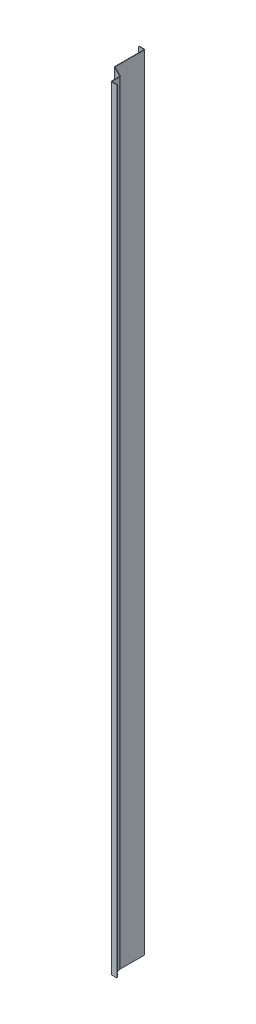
ISO-10303-21;
HEADER;
FILE_DESCRIPTION(('STEP AP214'),'2;1');
FILE_NAME('part.step','',(''),(''),'','','');
FILE_SCHEMA(('AUTOMOTIVE_DESIGN { 1 0 10303 214 1 1 1 1 }'));
ENDSEC;
DATA;
#1=APPLICATION_CONTEXT('core data for automotive mechanical design processes');
#2=APPLICATION_PROTOCOL_DEFINITION('international standard','automotive_design',2000,#1);
#3=PRODUCT_CONTEXT('',#1,'mechanical');
#4=PRODUCT('Part','Part','',(#3));
#5=PRODUCT_RELATED_PRODUCT_CATEGORY('part','',(#4));
#6=PRODUCT_DEFINITION_FORMATION('','',#4);
#7=PRODUCT_DEFINITION_CONTEXT('part definition',#1,'design');
#8=PRODUCT_DEFINITION('design','',#6,#7);
#9=PRODUCT_DEFINITION_SHAPE('','',#8);
#10=(LENGTH_UNIT() NAMED_UNIT(*) SI_UNIT(.MILLI.,.METRE.));
#11=(NAMED_UNIT(*) PLANE_ANGLE_UNIT() SI_UNIT($,.RADIAN.));
#12=(NAMED_UNIT(*) SI_UNIT($,.STERADIAN.) SOLID_ANGLE_UNIT());
#13=UNCERTAINTY_MEASURE_WITH_UNIT(LENGTH_MEASURE(1.E-05),#10,'distance_accuracy_value','');
#14=(GEOMETRIC_REPRESENTATION_CONTEXT(3) GLOBAL_UNCERTAINTY_ASSIGNED_CONTEXT((#13)) GLOBAL_UNIT_ASSIGNED_CONTEXT((#10,
#11,#12)) REPRESENTATION_CONTEXT('',''));
#15=CARTESIAN_POINT('',(0.,0.,0.));
#16=DIRECTION('',(0.,0.,1.));
#17=DIRECTION('',(1.,0.,0.));
#18=AXIS2_PLACEMENT_3D('',#15,#16,#17);
#19=CARTESIAN_POINT('',(0.,0.,77.));
#20=DIRECTION('',(0.,0.,1.));
#21=DIRECTION('',(1.,0.,0.));
#22=AXIS2_PLACEMENT_3D('',#19,#20,#21);
#23=PLANE('',#22);
#24=DIRECTION('',(-0.707106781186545,-0.70710678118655,0.));
#25=VECTOR('',#24,1.);
#26=CARTESIAN_POINT('',(-419.7,-983.4,77.));
#27=LINE('',#26,#25);
#28=CARTESIAN_POINT('',(-408.1,-971.799999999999,77.));
#29=VERTEX_POINT('',#28);
#30=CARTESIAN_POINT('',(-418.7,-982.4,77.));
#31=VERTEX_POINT('',#30);
#32=EDGE_CURVE('E311',#29,#31,#27,.T.);
#33=ORIENTED_EDGE('',*,*,#32,.F.);
#34=DIRECTION('',(0.,1.,0.));
#35=VECTOR('',#34,1.);
#36=CARTESIAN_POINT('',(-408.1,-969.599999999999,77.));
#37=LINE('',#36,#35);
#38=CARTESIAN_POINT('',(-408.1,-969.599999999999,77.));
#39=VERTEX_POINT('',#38);
#40=EDGE_CURVE('E286',#29,#39,#37,.T.);
#41=ORIENTED_EDGE('',*,*,#40,.T.);
#42=DIRECTION('',(0.,1.,0.));
#43=VECTOR('',#42,1.);
#44=CARTESIAN_POINT('',(-408.1,969.6,76.9999999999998));
#45=LINE('',#44,#43);
#46=CARTESIAN_POINT('',(-408.1,969.6,76.9999999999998));
#47=VERTEX_POINT('',#46);
#48=EDGE_CURVE('E506',#47,#39,#45,.F.);
#49=ORIENTED_EDGE('',*,*,#48,.F.);
#50=DIRECTION('',(-1.,0.,0.));
#51=VECTOR('',#50,1.);
#52=CARTESIAN_POINT('',(-405.9,969.6,77.));
#53=LINE('',#52,#51);
#54=CARTESIAN_POINT('',(-406.140408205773,969.6,77.));
#55=VERTEX_POINT('',#54);
#56=EDGE_CURVE('E146',#55,#47,#53,.T.);
#57=ORIENTED_EDGE('',*,*,#56,.F.);
#58=CARTESIAN_POINT('',(-405.9,969.6,77.));
#59=VERTEX_POINT('',#58);
#60=EDGE_CURVE('E520',#59,#55,#53,.T.);
#61=ORIENTED_EDGE('',*,*,#60,.F.);
#62=DIRECTION('',(0.707106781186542,-0.707106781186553,0.));
#63=VECTOR('',#62,1.);
#64=CARTESIAN_POINT('',(-405.9,969.6,77.));
#65=LINE('',#64,#63);
#66=CARTESIAN_POINT('',(-418.7,982.4,77.));
#67=VERTEX_POINT('',#66);
#68=EDGE_CURVE('E307',#67,#59,#65,.T.);
#69=ORIENTED_EDGE('',*,*,#68,.F.);
#70=DIRECTION('',(0.,-1.,0.));
#71=VECTOR('',#70,1.);
#72=CARTESIAN_POINT('',(-418.7,0.,77.));
#73=LINE('',#72,#71);
#74=EDGE_CURVE('E313',#67,#31,#73,.T.);
#75=ORIENTED_EDGE('',*,*,#74,.T.);
#76=EDGE_LOOP('',(#33,#41,#49,#57,#61,#69,#75));
#77=FACE_BOUND('',#76,.T.);
#78=ADVANCED_FACE('F121',(#77),#23,.T.);
#79=CARTESIAN_POINT('',(0.,0.,75.8));
#80=DIRECTION('',(0.,0.,1.));
#81=DIRECTION('',(1.,0.,0.));
#82=AXIS2_PLACEMENT_3D('',#79,#80,#81);
#83=PLANE('',#82);
#84=DIRECTION('',(0.,1.,0.));
#85=VECTOR('',#84,1.);
#86=CARTESIAN_POINT('',(-408.1,0.,75.8));
#87=LINE('',#86,#85);
#88=CARTESIAN_POINT('',(-408.1,-971.799999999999,75.8));
#89=VERTEX_POINT('',#88);
#90=CARTESIAN_POINT('',(-408.1,-969.599999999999,75.8));
#91=VERTEX_POINT('',#90);
#92=EDGE_CURVE('E283',#89,#91,#87,.T.);
#93=ORIENTED_EDGE('',*,*,#92,.F.);
#94=DIRECTION('',(0.707106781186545,0.70710678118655,0.));
#95=VECTOR('',#94,1.);
#96=CARTESIAN_POINT('',(281.849999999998,-281.849999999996,75.8));
#97=LINE('',#96,#95);
#98=CARTESIAN_POINT('',(-418.7,-982.4,75.8));
#99=VERTEX_POINT('',#98);
#100=EDGE_CURVE('E296',#89,#99,#97,.F.);
#101=ORIENTED_EDGE('',*,*,#100,.T.);
#102=DIRECTION('',(0.,1.,0.));
#103=VECTOR('',#102,1.);
#104=CARTESIAN_POINT('',(-418.7,982.4,75.8));
#105=LINE('',#104,#103);
#106=CARTESIAN_POINT('',(-418.7,982.4,75.8));
#107=VERTEX_POINT('',#106);
#108=EDGE_CURVE('E320',#107,#99,#105,.F.);
#109=ORIENTED_EDGE('',*,*,#108,.F.);
#110=DIRECTION('',(-0.707106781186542,0.707106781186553,0.));
#111=VECTOR('',#110,1.);
#112=CARTESIAN_POINT('',(281.849999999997,281.849999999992,75.8));
#113=LINE('',#112,#111);
#114=CARTESIAN_POINT('',(-405.9,969.6,75.8));
#115=VERTEX_POINT('',#114);
#116=EDGE_CURVE('E308',#107,#115,#113,.F.);
#117=ORIENTED_EDGE('',*,*,#116,.T.);
#118=DIRECTION('',(1.,0.,0.));
#119=VECTOR('',#118,1.);
#120=CARTESIAN_POINT('',(0.,969.6,75.8));
#121=LINE('',#120,#119);
#122=CARTESIAN_POINT('',(-408.1,969.6,75.8));
#123=VERTEX_POINT('',#122);
#124=EDGE_CURVE('E325',#123,#115,#121,.T.);
#125=ORIENTED_EDGE('',*,*,#124,.F.);
#126=DIRECTION('',(0.,1.,0.));
#127=VECTOR('',#126,1.);
#128=CARTESIAN_POINT('',(-408.1,969.6,75.7999999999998));
#129=LINE('',#128,#127);
#130=EDGE_CURVE('E300',#123,#91,#129,.F.);
#131=ORIENTED_EDGE('',*,*,#130,.T.);
#132=EDGE_LOOP('',(#93,#101,#109,#117,#125,#131));
#133=FACE_BOUND('',#132,.T.);
#134=ADVANCED_FACE('F294',(#133),#83,.F.);
#135=CARTESIAN_POINT('',(-419.7,-983.4,77.));
#136=DIRECTION('',(0.70710678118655,-0.707106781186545,0.));
#137=DIRECTION('',(0.707106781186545,0.70710678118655,0.));
#138=AXIS2_PLACEMENT_3D('',#135,#136,#137);
#139=PLANE('',#138);
#140=ORIENTED_EDGE('',*,*,#100,.F.);
#141=DIRECTION('',(0.,0.,1.));
#142=VECTOR('',#141,1.);
#143=CARTESIAN_POINT('',(-408.1,-971.799999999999,77.));
#144=LINE('',#143,#142);
#145=EDGE_CURVE('E280',#29,#89,#144,.F.);
#146=ORIENTED_EDGE('',*,*,#145,.F.);
#147=ORIENTED_EDGE('',*,*,#32,.T.);
#148=DIRECTION('',(0.,0.,1.));
#149=VECTOR('',#148,1.);
#150=CARTESIAN_POINT('',(-418.7,-982.4,75.7999999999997));
#151=LINE('',#150,#149);
#152=EDGE_CURVE('E306',#99,#31,#151,.T.);
#153=ORIENTED_EDGE('',*,*,#152,.F.);
#154=EDGE_LOOP('',(#140,#146,#147,#153));
#155=FACE_BOUND('',#154,.T.);
#156=ADVANCED_FACE('F304',(#155),#139,.T.);
#157=CARTESIAN_POINT('',(-405.9,969.6,98.8));
#158=DIRECTION('',(0.,-1.,0.));
#159=DIRECTION('',(0.,0.,-1.));
#160=AXIS2_PLACEMENT_3D('',#157,#158,#159);
#161=PLANE('',#160);
#162=DIRECTION('',(-1.,0.,0.));
#163=VECTOR('',#162,1.);
#164=CARTESIAN_POINT('',(-405.9,969.6,96.6));
#165=LINE('',#164,#163);
#166=CARTESIAN_POINT('',(-405.9,969.6,96.6));
#167=VERTEX_POINT('',#166);
#168=CARTESIAN_POINT('',(-407.1,969.6,96.6));
#169=VERTEX_POINT('',#168);
#170=EDGE_CURVE('E669',#167,#169,#165,.T.);
#171=ORIENTED_EDGE('',*,*,#170,.F.);
#172=DIRECTION('',(0.,0.,1.));
#173=VECTOR('',#172,1.);
#174=CARTESIAN_POINT('',(-405.9,969.6,1.02938711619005E-12));
#175=LINE('',#174,#173);
#176=CARTESIAN_POINT('',(-405.9,969.6,77.9999999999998));
#177=VERTEX_POINT('',#176);
#178=EDGE_CURVE('E675',#177,#167,#175,.T.);
#179=ORIENTED_EDGE('',*,*,#178,.F.);
#180=DIRECTION('',(-1.,0.,0.));
#181=VECTOR('',#180,1.);
#182=CARTESIAN_POINT('',(-407.1,969.6,78.));
#183=LINE('',#182,#181);
#184=CARTESIAN_POINT('',(-407.1,969.6,77.9999999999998));
#185=VERTEX_POINT('',#184);
#186=EDGE_CURVE('E498',#185,#177,#183,.F.);
#187=ORIENTED_EDGE('',*,*,#186,.F.);
#188=DIRECTION('',(0.,0.,-1.));
#189=VECTOR('',#188,1.);
#190=CARTESIAN_POINT('',(-407.1,969.6,98.8));
#191=LINE('',#190,#189);
#192=EDGE_CURVE('E680',#185,#169,#191,.F.);
#193=ORIENTED_EDGE('',*,*,#192,.T.);
#194=EDGE_LOOP('',(#171,#179,#187,#193));
#195=FACE_BOUND('',#194,.T.);
#196=ADVANCED_FACE('F460',(#195),#161,.F.);
#197=CARTESIAN_POINT('',(-405.9,-970.799999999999,76.9999999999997));
#198=DIRECTION('',(0.,1.,0.));
#199=DIRECTION('',(0.,0.,1.));
#200=AXIS2_PLACEMENT_3D('',#197,#198,#199);
#201=PLANE('',#200);
#202=DIRECTION('',(-1.,0.,0.));
#203=VECTOR('',#202,1.);
#204=CARTESIAN_POINT('',(-405.9,-970.799999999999,96.6));
#205=LINE('',#204,#203);
#206=CARTESIAN_POINT('',(-405.9,-970.799999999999,96.6));
#207=VERTEX_POINT('',#206);
#208=CARTESIAN_POINT('',(-407.1,-970.799999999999,96.6));
#209=VERTEX_POINT('',#208);
#210=EDGE_CURVE('E659',#207,#209,#205,.T.);
#211=ORIENTED_EDGE('',*,*,#210,.T.);
#212=DIRECTION('',(0.,0.,1.));
#213=VECTOR('',#212,1.);
#214=CARTESIAN_POINT('',(-407.1,-970.799999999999,76.9999999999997));
#215=LINE('',#214,#213);
#216=CARTESIAN_POINT('',(-407.1,-970.799999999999,77.9999999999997));
#217=VERTEX_POINT('',#216);
#218=EDGE_CURVE('E678',#209,#217,#215,.F.);
#219=ORIENTED_EDGE('',*,*,#218,.T.);
#220=DIRECTION('',(-1.,0.,0.));
#221=VECTOR('',#220,1.);
#222=CARTESIAN_POINT('',(-405.9,-970.799999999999,77.9999999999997));
#223=LINE('',#222,#221);
#224=CARTESIAN_POINT('',(-405.9,-970.799999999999,77.9999999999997));
#225=VERTEX_POINT('',#224);
#226=EDGE_CURVE('E671',#217,#225,#223,.F.);
#227=ORIENTED_EDGE('',*,*,#226,.T.);
#228=DIRECTION('',(0.,0.,-1.));
#229=VECTOR('',#228,1.);
#230=CARTESIAN_POINT('',(-405.9,-970.799999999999,-3.91467027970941E-12));
#231=LINE('',#230,#229);
#232=EDGE_CURVE('E516',#207,#225,#231,.T.);
#233=ORIENTED_EDGE('',*,*,#232,.F.);
#234=EDGE_LOOP('',(#211,#219,#227,#233));
#235=FACE_BOUND('',#234,.T.);
#236=ADVANCED_FACE('F464',(#235),#201,.F.);
#237=CARTESIAN_POINT('',(-405.9,0.,1.02938711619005E-12));
#238=DIRECTION('',(-1.,0.,0.));
#239=DIRECTION('',(0.,0.,1.));
#240=AXIS2_PLACEMENT_3D('',#237,#238,#239);
#241=PLANE('',#240);
#242=DIRECTION('',(0.,-1.,0.));
#243=VECTOR('',#242,1.);
#244=CARTESIAN_POINT('',(-405.9,-970.799999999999,96.6));
#245=LINE('',#244,#243);
#246=EDGE_CURVE('E665',#207,#167,#245,.F.);
#247=ORIENTED_EDGE('',*,*,#246,.F.);
#248=ORIENTED_EDGE('',*,*,#232,.T.);
#249=DIRECTION('',(0.,1.,0.));
#250=VECTOR('',#249,1.);
#251=CARTESIAN_POINT('',(-405.9,-970.799999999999,77.9999999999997));
#252=LINE('',#251,#250);
#253=CARTESIAN_POINT('',(-405.9,-969.599999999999,77.9999999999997));
#254=VERTEX_POINT('',#253);
#255=EDGE_CURVE('E684',#254,#225,#252,.F.);
#256=ORIENTED_EDGE('',*,*,#255,.F.);
#257=EDGE_CURVE('E533',#177,#254,#252,.F.);
#258=ORIENTED_EDGE('',*,*,#257,.F.);
#259=ORIENTED_EDGE('',*,*,#178,.T.);
#260=EDGE_LOOP('',(#247,#248,#256,#258,#259));
#261=FACE_BOUND('',#260,.T.);
#262=ADVANCED_FACE('F470',(#261),#241,.F.);
#263=CARTESIAN_POINT('',(-407.1,0.,1.03357689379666E-12));
#264=DIRECTION('',(-1.,0.,0.));
#265=DIRECTION('',(0.,0.,1.));
#266=AXIS2_PLACEMENT_3D('',#263,#264,#265);
#267=PLANE('',#266);
#268=ORIENTED_EDGE('',*,*,#218,.F.);
#269=DIRECTION('',(0.,-1.,0.));
#270=VECTOR('',#269,1.);
#271=CARTESIAN_POINT('',(-407.1,-970.799999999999,96.6));
#272=LINE('',#271,#270);
#273=EDGE_CURVE('E654',#209,#169,#272,.F.);
#274=ORIENTED_EDGE('',*,*,#273,.T.);
#275=ORIENTED_EDGE('',*,*,#192,.F.);
#276=DIRECTION('',(0.,1.,0.));
#277=VECTOR('',#276,1.);
#278=CARTESIAN_POINT('',(-407.1,969.6,77.9999999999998));
#279=LINE('',#278,#277);
#280=CARTESIAN_POINT('',(-407.1,-969.599999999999,77.9999999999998));
#281=VERTEX_POINT('',#280);
#282=EDGE_CURVE('E514',#281,#185,#279,.T.);
#283=ORIENTED_EDGE('',*,*,#282,.F.);
#284=DIRECTION('',(0.,1.,0.));
#285=VECTOR('',#284,1.);
#286=CARTESIAN_POINT('',(-407.1,-970.799999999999,77.9999999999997));
#287=LINE('',#286,#285);
#288=EDGE_CURVE('E686',#217,#281,#287,.T.);
#289=ORIENTED_EDGE('',*,*,#288,.F.);
#290=EDGE_LOOP('',(#268,#274,#275,#283,#289));
#291=FACE_BOUND('',#290,.T.);
#292=ADVANCED_FACE('F699',(#291),#267,.T.);
#293=CARTESIAN_POINT('',(-405.9,969.6,77.));
#294=DIRECTION('',(0.,-1.,0.));
#295=DIRECTION('',(0.,0.,-1.));
#296=AXIS2_PLACEMENT_3D('',#293,#294,#295);
#297=PLANE('',#296);
#298=ORIENTED_EDGE('',*,*,#60,.T.);
#299=CARTESIAN_POINT('',(-408.1,969.6,77.9999999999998));
#300=DIRECTION('',(0.,1.,0.));
#301=DIRECTION('',(0.,0.,1.));
#302=AXIS2_PLACEMENT_3D('',#299,#300,#301);
#303=CIRCLE('',#302,2.2);
#304=EDGE_CURVE('E13',#55,#123,#303,.T.);
#305=ORIENTED_EDGE('',*,*,#304,.T.);
#306=ORIENTED_EDGE('',*,*,#124,.T.);
#307=DIRECTION('',(0.,0.,-1.));
#308=VECTOR('',#307,1.);
#309=CARTESIAN_POINT('',(-405.9,969.6,77.));
#310=LINE('',#309,#308);
#311=EDGE_CURVE('E386',#59,#115,#310,.T.);
#312=ORIENTED_EDGE('',*,*,#311,.F.);
#313=EDGE_LOOP('',(#298,#305,#306,#312));
#314=FACE_BOUND('',#313,.T.);
#315=ADVANCED_FACE('F417',(#314),#297,.T.);
#316=CARTESIAN_POINT('',(-419.7,983.4,77.));
#317=DIRECTION('',(0.,-1.,0.));
#318=DIRECTION('',(0.,0.,-1.));
#319=AXIS2_PLACEMENT_3D('',#316,#317,#318);
#320=PLANE('',#319);
#321=DIRECTION('',(-1.,0.,0.));
#322=VECTOR('',#321,1.);
#323=CARTESIAN_POINT('',(-419.7,983.4,74.8));
#324=LINE('',#323,#322);
#325=CARTESIAN_POINT('',(-419.7,983.4,74.8));
#326=VERTEX_POINT('',#325);
#327=CARTESIAN_POINT('',(-420.9,983.4,74.8));
#328=VERTEX_POINT('',#327);
#329=EDGE_CURVE('E335',#326,#328,#324,.T.);
#330=ORIENTED_EDGE('',*,*,#329,.F.);
#331=DIRECTION('',(0.,0.,1.));
#332=VECTOR('',#331,1.);
#333=CARTESIAN_POINT('',(-419.7,983.4,1.53261960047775E-12));
#334=LINE('',#333,#332);
#335=CARTESIAN_POINT('',(-419.7,983.4,2.19999999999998));
#336=VERTEX_POINT('',#335);
#337=EDGE_CURVE('E1253',#336,#326,#334,.T.);
#338=ORIENTED_EDGE('',*,*,#337,.F.);
#339=DIRECTION('',(-1.,0.,0.));
#340=VECTOR('',#339,1.);
#341=CARTESIAN_POINT('',(-420.9,983.4,2.19999999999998));
#342=LINE('',#341,#340);
#343=CARTESIAN_POINT('',(-420.9,983.4,2.19999999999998));
#344=VERTEX_POINT('',#343);
#345=EDGE_CURVE('E1243',#344,#336,#342,.F.);
#346=ORIENTED_EDGE('',*,*,#345,.F.);
#347=DIRECTION('',(0.,0.,-1.));
#348=VECTOR('',#347,1.);
#349=CARTESIAN_POINT('',(-420.9,983.4,77.));
#350=LINE('',#349,#348);
#351=EDGE_CURVE('E1249',#344,#328,#350,.F.);
#352=ORIENTED_EDGE('',*,*,#351,.T.);
#353=EDGE_LOOP('',(#330,#338,#346,#352));
#354=FACE_BOUND('',#353,.T.);
#355=ADVANCED_FACE('F413',(#354),#320,.F.);
#356=CARTESIAN_POINT('',(-419.7,-983.399999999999,1.2));
#357=DIRECTION('',(0.,1.,0.));
#358=DIRECTION('',(0.,0.,1.));
#359=AXIS2_PLACEMENT_3D('',#356,#357,#358);
#360=PLANE('',#359);
#361=DIRECTION('',(-1.,0.,0.));
#362=VECTOR('',#361,1.);
#363=CARTESIAN_POINT('',(-419.7,-983.4,74.8));
#364=LINE('',#363,#362);
#365=CARTESIAN_POINT('',(-419.7,-983.4,74.8));
#366=VERTEX_POINT('',#365);
#367=CARTESIAN_POINT('',(-420.9,-983.4,74.8));
#368=VERTEX_POINT('',#367);
#369=EDGE_CURVE('E339',#366,#368,#364,.T.);
#370=ORIENTED_EDGE('',*,*,#369,.T.);
#371=DIRECTION('',(0.,0.,1.));
#372=VECTOR('',#371,1.);
#373=CARTESIAN_POINT('',(-420.9,-983.399999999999,1.2));
#374=LINE('',#373,#372);
#375=CARTESIAN_POINT('',(-420.9,-983.399999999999,2.19999999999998));
#376=VERTEX_POINT('',#375);
#377=EDGE_CURVE('E1252',#368,#376,#374,.F.);
#378=ORIENTED_EDGE('',*,*,#377,.T.);
#379=DIRECTION('',(-1.,0.,0.));
#380=VECTOR('',#379,1.);
#381=CARTESIAN_POINT('',(-419.7,-983.399999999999,2.19999999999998));
#382=LINE('',#381,#380);
#383=CARTESIAN_POINT('',(-419.7,-983.399999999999,2.19999999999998));
#384=VERTEX_POINT('',#383);
#385=EDGE_CURVE('E338',#376,#384,#382,.F.);
#386=ORIENTED_EDGE('',*,*,#385,.T.);
#387=DIRECTION('',(0.,0.,-1.));
#388=VECTOR('',#387,1.);
#389=CARTESIAN_POINT('',(-419.7,-983.399999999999,-4.22882273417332E-12));
#390=LINE('',#389,#388);
#391=EDGE_CURVE('E387',#366,#384,#390,.T.);
#392=ORIENTED_EDGE('',*,*,#391,.F.);
#393=EDGE_LOOP('',(#370,#378,#386,#392));
#394=FACE_BOUND('',#393,.T.);
#395=ADVANCED_FACE('F405',(#394),#360,.F.);
#396=CARTESIAN_POINT('',(-419.7,0.,1.53261960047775E-12));
#397=DIRECTION('',(-1.,0.,0.));
#398=DIRECTION('',(0.,0.,1.));
#399=AXIS2_PLACEMENT_3D('',#396,#397,#398);
#400=PLANE('',#399);
#401=DIRECTION('',(0.,-1.,0.));
#402=VECTOR('',#401,1.);
#403=CARTESIAN_POINT('',(-419.7,-983.4,74.8));
#404=LINE('',#403,#402);
#405=EDGE_CURVE('E326',#366,#326,#404,.F.);
#406=ORIENTED_EDGE('',*,*,#405,.F.);
#407=ORIENTED_EDGE('',*,*,#391,.T.);
#408=DIRECTION('',(0.,1.,0.));
#409=VECTOR('',#408,1.);
#410=CARTESIAN_POINT('',(-419.7,-983.399999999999,2.19999999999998));
#411=LINE('',#410,#409);
#412=EDGE_CURVE('E1246',#336,#384,#411,.F.);
#413=ORIENTED_EDGE('',*,*,#412,.F.);
#414=ORIENTED_EDGE('',*,*,#337,.T.);
#415=EDGE_LOOP('',(#406,#407,#413,#414));
#416=FACE_BOUND('',#415,.T.);
#417=ADVANCED_FACE('F395',(#416),#400,.F.);
#418=CARTESIAN_POINT('',(-420.9,0.,1.53680937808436E-12));
#419=DIRECTION('',(-1.,0.,0.));
#420=DIRECTION('',(0.,0.,1.));
#421=AXIS2_PLACEMENT_3D('',#418,#419,#420);
#422=PLANE('',#421);
#423=ORIENTED_EDGE('',*,*,#377,.F.);
#424=DIRECTION('',(0.,-1.,0.));
#425=VECTOR('',#424,1.);
#426=CARTESIAN_POINT('',(-420.9,-983.4,74.8));
#427=LINE('',#426,#425);
#428=EDGE_CURVE('E330',#368,#328,#427,.F.);
#429=ORIENTED_EDGE('',*,*,#428,.T.);
#430=ORIENTED_EDGE('',*,*,#351,.F.);
#431=DIRECTION('',(0.,1.,0.));
#432=VECTOR('',#431,1.);
#433=CARTESIAN_POINT('',(-420.9,-983.399999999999,2.19999999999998));
#434=LINE('',#433,#432);
#435=EDGE_CURVE('E1241',#376,#344,#434,.T.);
#436=ORIENTED_EDGE('',*,*,#435,.F.);
#437=EDGE_LOOP('',(#423,#429,#430,#436));
#438=FACE_BOUND('',#437,.T.);
#439=ADVANCED_FACE('F404',(#438),#422,.T.);
#440=CARTESIAN_POINT('',(-434.7,-983.399999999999,1.2));
#441=DIRECTION('',(0.,1.,0.));
#442=DIRECTION('',(0.,0.,1.));
#443=AXIS2_PLACEMENT_3D('',#440,#441,#442);
#444=PLANE('',#443);
#445=DIRECTION('',(0.,0.,-1.));
#446=VECTOR('',#445,1.);
#447=CARTESIAN_POINT('',(-421.9,-983.399999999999,1.19999999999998));
#448=LINE('',#447,#446);
#449=CARTESIAN_POINT('',(-421.9,-983.399999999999,1.19999999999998));
#450=VERTEX_POINT('',#449);
#451=CARTESIAN_POINT('',(-421.9,-983.399999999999,0.));
#452=VERTEX_POINT('',#451);
#453=EDGE_CURVE('E1199',#450,#452,#448,.T.);
#454=ORIENTED_EDGE('',*,*,#453,.F.);
#455=DIRECTION('',(1.,0.,0.));
#456=VECTOR('',#455,1.);
#457=CARTESIAN_POINT('',(-434.7,-983.399999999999,1.2));
#458=LINE('',#457,#456);
#459=CARTESIAN_POINT('',(-434.7,-983.399999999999,1.2));
#460=VERTEX_POINT('',#459);
#461=EDGE_CURVE('E1212',#460,#450,#458,.T.);
#462=ORIENTED_EDGE('',*,*,#461,.F.);
#463=DIRECTION('',(0.,0.,-1.));
#464=VECTOR('',#463,1.);
#465=CARTESIAN_POINT('',(-434.7,-983.399999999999,1.2));
#466=LINE('',#465,#464);
#467=CARTESIAN_POINT('',(-434.7,-983.399999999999,0.));
#468=VERTEX_POINT('',#467);
#469=EDGE_CURVE('E125',#460,#468,#466,.T.);
#470=ORIENTED_EDGE('',*,*,#469,.T.);
#471=DIRECTION('',(1.,0.,0.));
#472=VECTOR('',#471,1.);
#473=CARTESIAN_POINT('',(-434.7,-983.399999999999,0.));
#474=LINE('',#473,#472);
#475=EDGE_CURVE('E1198',#468,#452,#474,.T.);
#476=ORIENTED_EDGE('',*,*,#475,.T.);
#477=EDGE_LOOP('',(#454,#462,#470,#476));
#478=FACE_BOUND('',#477,.T.);
#479=ADVANCED_FACE('F409',(#478),#444,.F.);
#480=CARTESIAN_POINT('',(-434.7,983.4,1.2));
#481=DIRECTION('',(0.,-1.,0.));
#482=DIRECTION('',(0.,0.,-1.));
#483=AXIS2_PLACEMENT_3D('',#480,#481,#482);
#484=PLANE('',#483);
#485=DIRECTION('',(0.,0.,-1.));
#486=VECTOR('',#485,1.);
#487=CARTESIAN_POINT('',(-421.9,983.4,1.19999999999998));
#488=LINE('',#487,#486);
#489=CARTESIAN_POINT('',(-421.9,983.4,1.19999999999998));
#490=VERTEX_POINT('',#489);
#491=CARTESIAN_POINT('',(-421.9,983.4,0.));
#492=VERTEX_POINT('',#491);
#493=EDGE_CURVE('E1205',#490,#492,#488,.T.);
#494=ORIENTED_EDGE('',*,*,#493,.T.);
#495=DIRECTION('',(-1.,0.,0.));
#496=VECTOR('',#495,1.);
#497=CARTESIAN_POINT('',(-434.7,983.4,0.));
#498=LINE('',#497,#496);
#499=CARTESIAN_POINT('',(-434.7,983.4,0.));
#500=VERTEX_POINT('',#499);
#501=EDGE_CURVE('E1202',#492,#500,#498,.T.);
#502=ORIENTED_EDGE('',*,*,#501,.T.);
#503=DIRECTION('',(0.,0.,-1.));
#504=VECTOR('',#503,1.);
#505=CARTESIAN_POINT('',(-434.7,983.4,1.2));
#506=LINE('',#505,#504);
#507=CARTESIAN_POINT('',(-434.7,983.4,1.2));
#508=VERTEX_POINT('',#507);
#509=EDGE_CURVE('E1195',#508,#500,#506,.T.);
#510=ORIENTED_EDGE('',*,*,#509,.F.);
#511=DIRECTION('',(-1.,0.,0.));
#512=VECTOR('',#511,1.);
#513=CARTESIAN_POINT('',(-434.7,983.4,1.2));
#514=LINE('',#513,#512);
#515=EDGE_CURVE('E1208',#490,#508,#514,.T.);
#516=ORIENTED_EDGE('',*,*,#515,.F.);
#517=EDGE_LOOP('',(#494,#502,#510,#516));
#518=FACE_BOUND('',#517,.T.);
#519=ADVANCED_FACE('F439',(#518),#484,.F.);
#520=CARTESIAN_POINT('',(0.,0.,1.2));
#521=DIRECTION('',(0.,0.,-1.));
#522=DIRECTION('',(-1.,0.,0.));
#523=AXIS2_PLACEMENT_3D('',#520,#521,#522);
#524=PLANE('',#523);
#525=CARTESIAN_POINT('',(-428.3,-953.4,1.20000000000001));
#526=DIRECTION('',(0.,0.,-1.));
#527=DIRECTION('',(-1.,0.,0.));
#528=AXIS2_PLACEMENT_3D('',#525,#526,#527);
#529=CIRCLE('',#528,3.99999999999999);
#530=CARTESIAN_POINT('',(-432.3,-953.4,1.20000000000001));
#531=VERTEX_POINT('',#530);
#532=EDGE_CURVE('E541',#531,#531,#529,.F.);
#533=ORIENTED_EDGE('',*,*,#532,.F.);
#534=EDGE_LOOP('',(#533));
#535=FACE_BOUND('',#534,.T.);
#536=CARTESIAN_POINT('',(-428.299999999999,-741.533333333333,1.20000000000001));
#537=DIRECTION('',(0.,0.,-1.));
#538=DIRECTION('',(-1.,0.,0.));
#539=AXIS2_PLACEMENT_3D('',#536,#537,#538);
#540=CIRCLE('',#539,3.99999999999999);
#541=CARTESIAN_POINT('',(-432.299999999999,-741.533333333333,1.20000000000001));
#542=VERTEX_POINT('',#541);
#543=EDGE_CURVE('E542',#542,#542,#540,.F.);
#544=ORIENTED_EDGE('',*,*,#543,.F.);
#545=EDGE_LOOP('',(#544));
#546=FACE_BOUND('',#545,.T.);
#547=CARTESIAN_POINT('',(-428.299999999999,-529.666666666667,1.20000000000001));
#548=DIRECTION('',(0.,0.,-1.));
#549=DIRECTION('',(-1.,0.,0.));
#550=AXIS2_PLACEMENT_3D('',#547,#548,#549);
#551=CIRCLE('',#550,3.99999999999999);
#552=CARTESIAN_POINT('',(-432.299999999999,-529.666666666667,1.20000000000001));
#553=VERTEX_POINT('',#552);
#554=EDGE_CURVE('E549',#553,#553,#551,.F.);
#555=ORIENTED_EDGE('',*,*,#554,.F.);
#556=EDGE_LOOP('',(#555));
#557=FACE_BOUND('',#556,.T.);
#558=CARTESIAN_POINT('',(-428.299999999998,-317.8,1.20000000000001));
#559=DIRECTION('',(0.,0.,-1.));
#560=DIRECTION('',(-1.,0.,0.));
#561=AXIS2_PLACEMENT_3D('',#558,#559,#560);
#562=CIRCLE('',#561,3.99999999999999);
#563=CARTESIAN_POINT('',(-432.299999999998,-317.8,1.20000000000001));
#564=VERTEX_POINT('',#563);
#565=EDGE_CURVE('E555',#564,#564,#562,.F.);
#566=ORIENTED_EDGE('',*,*,#565,.F.);
#567=EDGE_LOOP('',(#566));
#568=FACE_BOUND('',#567,.T.);
#569=CARTESIAN_POINT('',(-428.299999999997,-105.933333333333,1.20000000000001));
#570=DIRECTION('',(0.,0.,-1.));
#571=DIRECTION('',(-1.,0.,0.));
#572=AXIS2_PLACEMENT_3D('',#569,#570,#571);
#573=CIRCLE('',#572,3.99999999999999);
#574=CARTESIAN_POINT('',(-432.299999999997,-105.933333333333,1.20000000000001));
#575=VERTEX_POINT('',#574);
#576=EDGE_CURVE('E561',#575,#575,#573,.F.);
#577=ORIENTED_EDGE('',*,*,#576,.F.);
#578=EDGE_LOOP('',(#577));
#579=FACE_BOUND('',#578,.T.);
#580=CARTESIAN_POINT('',(-428.299999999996,105.933333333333,1.20000000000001));
#581=DIRECTION('',(0.,0.,-1.));
#582=DIRECTION('',(-1.,0.,0.));
#583=AXIS2_PLACEMENT_3D('',#580,#581,#582);
#584=CIRCLE('',#583,3.99999999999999);
#585=CARTESIAN_POINT('',(-432.299999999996,105.933333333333,1.20000000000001));
#586=VERTEX_POINT('',#585);
#587=EDGE_CURVE('E567',#586,#586,#584,.F.);
#588=ORIENTED_EDGE('',*,*,#587,.F.);
#589=EDGE_LOOP('',(#588));
#590=FACE_BOUND('',#589,.T.);
#591=CARTESIAN_POINT('',(-428.299999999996,317.8,1.20000000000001));
#592=DIRECTION('',(0.,0.,-1.));
#593=DIRECTION('',(-1.,0.,0.));
#594=AXIS2_PLACEMENT_3D('',#591,#592,#593);
#595=CIRCLE('',#594,3.99999999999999);
#596=CARTESIAN_POINT('',(-432.299999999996,317.8,1.20000000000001));
#597=VERTEX_POINT('',#596);
#598=EDGE_CURVE('E573',#597,#597,#595,.F.);
#599=ORIENTED_EDGE('',*,*,#598,.F.);
#600=EDGE_LOOP('',(#599));
#601=FACE_BOUND('',#600,.T.);
#602=CARTESIAN_POINT('',(-428.299999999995,529.666666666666,1.20000000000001));
#603=DIRECTION('',(0.,0.,-1.));
#604=DIRECTION('',(-1.,0.,0.));
#605=AXIS2_PLACEMENT_3D('',#602,#603,#604);
#606=CIRCLE('',#605,3.99999999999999);
#607=CARTESIAN_POINT('',(-432.299999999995,529.666666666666,1.20000000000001));
#608=VERTEX_POINT('',#607);
#609=EDGE_CURVE('E579',#608,#608,#606,.F.);
#610=ORIENTED_EDGE('',*,*,#609,.F.);
#611=EDGE_LOOP('',(#610));
#612=FACE_BOUND('',#611,.T.);
#613=CARTESIAN_POINT('',(-428.299999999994,741.533333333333,1.20000000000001));
#614=DIRECTION('',(0.,0.,-1.));
#615=DIRECTION('',(-1.,0.,0.));
#616=AXIS2_PLACEMENT_3D('',#613,#614,#615);
#617=CIRCLE('',#616,3.99999999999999);
#618=CARTESIAN_POINT('',(-432.299999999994,741.533333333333,1.20000000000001));
#619=VERTEX_POINT('',#618);
#620=EDGE_CURVE('E585',#619,#619,#617,.F.);
#621=ORIENTED_EDGE('',*,*,#620,.F.);
#622=EDGE_LOOP('',(#621));
#623=FACE_BOUND('',#622,.T.);
#624=CARTESIAN_POINT('',(-428.3,953.4,1.20000000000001));
#625=DIRECTION('',(0.,0.,-1.));
#626=DIRECTION('',(-1.,0.,0.));
#627=AXIS2_PLACEMENT_3D('',#624,#625,#626);
#628=CIRCLE('',#627,3.99999999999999);
#629=CARTESIAN_POINT('',(-432.3,953.4,1.20000000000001));
#630=VERTEX_POINT('',#629);
#631=EDGE_CURVE('E591',#630,#630,#628,.F.);
#632=ORIENTED_EDGE('',*,*,#631,.F.);
#633=EDGE_LOOP('',(#632));
#634=FACE_BOUND('',#633,.T.);
#635=CARTESIAN_POINT('',(-428.3,-973.4,1.2));
#636=DIRECTION('',(0.,0.,1.));
#637=DIRECTION('',(1.,0.,0.));
#638=AXIS2_PLACEMENT_3D('',#635,#636,#637);
#639=CIRCLE('',#638,1.50000000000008);
#640=CARTESIAN_POINT('',(-426.8,-973.4,1.2));
#641=VERTEX_POINT('',#640);
#642=EDGE_CURVE('E602',#641,#641,#639,.T.);
#643=ORIENTED_EDGE('',*,*,#642,.F.);
#644=EDGE_LOOP('',(#643));
#645=FACE_BOUND('',#644,.T.);
#646=CARTESIAN_POINT('',(-428.300000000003,-1.11022302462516E-13,1.2));
#647=DIRECTION('',(0.,0.,1.));
#648=DIRECTION('',(1.,0.,0.));
#649=AXIS2_PLACEMENT_3D('',#646,#647,#648);
#650=CIRCLE('',#649,1.50000000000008);
#651=CARTESIAN_POINT('',(-426.800000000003,-1.11022302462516E-13,1.2));
#652=VERTEX_POINT('',#651);
#653=EDGE_CURVE('E608',#652,#652,#650,.T.);
#654=ORIENTED_EDGE('',*,*,#653,.F.);
#655=EDGE_LOOP('',(#654));
#656=FACE_BOUND('',#655,.T.);
#657=CARTESIAN_POINT('',(-428.3,973.4,1.2));
#658=DIRECTION('',(0.,0.,1.));
#659=DIRECTION('',(1.,0.,0.));
#660=AXIS2_PLACEMENT_3D('',#657,#658,#659);
#661=CIRCLE('',#660,1.50000000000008);
#662=CARTESIAN_POINT('',(-426.8,973.4,1.2));
#663=VERTEX_POINT('',#662);
#664=EDGE_CURVE('E614',#663,#663,#661,.T.);
#665=ORIENTED_EDGE('',*,*,#664,.F.);
#666=EDGE_LOOP('',(#665));
#667=FACE_BOUND('',#666,.T.);
#668=CARTESIAN_POINT('',(-428.3,-963.4,1.2));
#669=DIRECTION('',(0.,0.,1.));
#670=DIRECTION('',(1.,0.,0.));
#671=AXIS2_PLACEMENT_3D('',#668,#669,#670);
#672=CIRCLE('',#671,1.50000000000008);
#673=CARTESIAN_POINT('',(-426.8,-963.4,1.2));
#674=VERTEX_POINT('',#673);
#675=EDGE_CURVE('E545',#674,#674,#672,.T.);
#676=ORIENTED_EDGE('',*,*,#675,.F.);
#677=EDGE_LOOP('',(#676));
#678=FACE_BOUND('',#677,.T.);
#679=DIRECTION('',(0.,1.,0.));
#680=VECTOR('',#679,1.);
#681=CARTESIAN_POINT('',(-421.9,983.4,1.19999999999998));
#682=LINE('',#681,#680);
#683=EDGE_CURVE('E1226',#490,#450,#682,.F.);
#684=ORIENTED_EDGE('',*,*,#683,.F.);
#685=ORIENTED_EDGE('',*,*,#515,.T.);
#686=DIRECTION('',(0.,-1.,0.));
#687=VECTOR('',#686,1.);
#688=CARTESIAN_POINT('',(-434.7,-983.399999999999,1.2));
#689=LINE('',#688,#687);
#690=EDGE_CURVE('E1211',#508,#460,#689,.T.);
#691=ORIENTED_EDGE('',*,*,#690,.T.);
#692=ORIENTED_EDGE('',*,*,#461,.T.);
#693=EDGE_LOOP('',(#684,#685,#691,#692));
#694=FACE_BOUND('',#693,.T.);
#695=ADVANCED_FACE('F435',(#535,#546,#557,#568,#579,#590,#601,#612,#623,#634,#645,#656,#667,
#678,#694),#524,.F.);
#696=CARTESIAN_POINT('',(0.,0.,0.));
#697=DIRECTION('',(0.,0.,-1.));
#698=DIRECTION('',(-1.,0.,0.));
#699=AXIS2_PLACEMENT_3D('',#696,#697,#698);
#700=PLANE('',#699);
#701=CARTESIAN_POINT('',(-428.3,-953.4,0.));
#702=DIRECTION('',(0.,0.,-1.));
#703=DIRECTION('',(-1.,0.,0.));
#704=AXIS2_PLACEMENT_3D('',#701,#702,#703);
#705=CIRCLE('',#704,3.99999999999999);
#706=CARTESIAN_POINT('',(-432.3,-953.4,0.));
#707=VERTEX_POINT('',#706);
#708=EDGE_CURVE('E538',#707,#707,#705,.T.);
#709=ORIENTED_EDGE('',*,*,#708,.F.);
#710=EDGE_LOOP('',(#709));
#711=FACE_BOUND('',#710,.T.);
#712=CARTESIAN_POINT('',(-428.299999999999,-741.533333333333,0.));
#713=DIRECTION('',(0.,0.,-1.));
#714=DIRECTION('',(-1.,0.,0.));
#715=AXIS2_PLACEMENT_3D('',#712,#713,#714);
#716=CIRCLE('',#715,3.99999999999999);
#717=CARTESIAN_POINT('',(-432.299999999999,-741.533333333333,0.));
#718=VERTEX_POINT('',#717);
#719=EDGE_CURVE('E546',#718,#718,#716,.T.);
#720=ORIENTED_EDGE('',*,*,#719,.F.);
#721=EDGE_LOOP('',(#720));
#722=FACE_BOUND('',#721,.T.);
#723=CARTESIAN_POINT('',(-428.299999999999,-529.666666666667,0.));
#724=DIRECTION('',(0.,0.,-1.));
#725=DIRECTION('',(-1.,0.,0.));
#726=AXIS2_PLACEMENT_3D('',#723,#724,#725);
#727=CIRCLE('',#726,3.99999999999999);
#728=CARTESIAN_POINT('',(-432.299999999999,-529.666666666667,0.));
#729=VERTEX_POINT('',#728);
#730=EDGE_CURVE('E552',#729,#729,#727,.T.);
#731=ORIENTED_EDGE('',*,*,#730,.F.);
#732=EDGE_LOOP('',(#731));
#733=FACE_BOUND('',#732,.T.);
#734=CARTESIAN_POINT('',(-428.299999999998,-317.8,0.));
#735=DIRECTION('',(0.,0.,-1.));
#736=DIRECTION('',(-1.,0.,0.));
#737=AXIS2_PLACEMENT_3D('',#734,#735,#736);
#738=CIRCLE('',#737,3.99999999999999);
#739=CARTESIAN_POINT('',(-432.299999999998,-317.8,0.));
#740=VERTEX_POINT('',#739);
#741=EDGE_CURVE('E558',#740,#740,#738,.T.);
#742=ORIENTED_EDGE('',*,*,#741,.F.);
#743=EDGE_LOOP('',(#742));
#744=FACE_BOUND('',#743,.T.);
#745=CARTESIAN_POINT('',(-428.299999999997,-105.933333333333,0.));
#746=DIRECTION('',(0.,0.,-1.));
#747=DIRECTION('',(-1.,0.,0.));
#748=AXIS2_PLACEMENT_3D('',#745,#746,#747);
#749=CIRCLE('',#748,3.99999999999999);
#750=CARTESIAN_POINT('',(-432.299999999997,-105.933333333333,0.));
#751=VERTEX_POINT('',#750);
#752=EDGE_CURVE('E564',#751,#751,#749,.T.);
#753=ORIENTED_EDGE('',*,*,#752,.F.);
#754=EDGE_LOOP('',(#753));
#755=FACE_BOUND('',#754,.T.);
#756=CARTESIAN_POINT('',(-428.299999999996,105.933333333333,0.));
#757=DIRECTION('',(0.,0.,-1.));
#758=DIRECTION('',(-1.,0.,0.));
#759=AXIS2_PLACEMENT_3D('',#756,#757,#758);
#760=CIRCLE('',#759,3.99999999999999);
#761=CARTESIAN_POINT('',(-432.299999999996,105.933333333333,0.));
#762=VERTEX_POINT('',#761);
#763=EDGE_CURVE('E570',#762,#762,#760,.T.);
#764=ORIENTED_EDGE('',*,*,#763,.F.);
#765=EDGE_LOOP('',(#764));
#766=FACE_BOUND('',#765,.T.);
#767=CARTESIAN_POINT('',(-428.299999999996,317.8,0.));
#768=DIRECTION('',(0.,0.,-1.));
#769=DIRECTION('',(-1.,0.,0.));
#770=AXIS2_PLACEMENT_3D('',#767,#768,#769);
#771=CIRCLE('',#770,3.99999999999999);
#772=CARTESIAN_POINT('',(-432.299999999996,317.8,0.));
#773=VERTEX_POINT('',#772);
#774=EDGE_CURVE('E576',#773,#773,#771,.T.);
#775=ORIENTED_EDGE('',*,*,#774,.F.);
#776=EDGE_LOOP('',(#775));
#777=FACE_BOUND('',#776,.T.);
#778=CARTESIAN_POINT('',(-428.299999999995,529.666666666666,0.));
#779=DIRECTION('',(0.,0.,-1.));
#780=DIRECTION('',(-1.,0.,0.));
#781=AXIS2_PLACEMENT_3D('',#778,#779,#780);
#782=CIRCLE('',#781,3.99999999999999);
#783=CARTESIAN_POINT('',(-432.299999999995,529.666666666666,0.));
#784=VERTEX_POINT('',#783);
#785=EDGE_CURVE('E582',#784,#784,#782,.T.);
#786=ORIENTED_EDGE('',*,*,#785,.F.);
#787=EDGE_LOOP('',(#786));
#788=FACE_BOUND('',#787,.T.);
#789=CARTESIAN_POINT('',(-428.299999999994,741.533333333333,0.));
#790=DIRECTION('',(0.,0.,-1.));
#791=DIRECTION('',(-1.,0.,0.));
#792=AXIS2_PLACEMENT_3D('',#789,#790,#791);
#793=CIRCLE('',#792,3.99999999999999);
#794=CARTESIAN_POINT('',(-432.299999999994,741.533333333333,0.));
#795=VERTEX_POINT('',#794);
#796=EDGE_CURVE('E588',#795,#795,#793,.T.);
#797=ORIENTED_EDGE('',*,*,#796,.F.);
#798=EDGE_LOOP('',(#797));
#799=FACE_BOUND('',#798,.T.);
#800=CARTESIAN_POINT('',(-428.3,953.4,0.));
#801=DIRECTION('',(0.,0.,-1.));
#802=DIRECTION('',(-1.,0.,0.));
#803=AXIS2_PLACEMENT_3D('',#800,#801,#802);
#804=CIRCLE('',#803,3.99999999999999);
#805=CARTESIAN_POINT('',(-432.3,953.4,0.));
#806=VERTEX_POINT('',#805);
#807=EDGE_CURVE('E290',#806,#806,#804,.T.);
#808=ORIENTED_EDGE('',*,*,#807,.F.);
#809=EDGE_LOOP('',(#808));
#810=FACE_BOUND('',#809,.T.);
#811=CARTESIAN_POINT('',(-428.3,-973.4,0.));
#812=DIRECTION('',(0.,0.,1.));
#813=DIRECTION('',(1.,0.,0.));
#814=AXIS2_PLACEMENT_3D('',#811,#812,#813);
#815=CIRCLE('',#814,1.50000000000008);
#816=CARTESIAN_POINT('',(-426.8,-973.4,0.));
#817=VERTEX_POINT('',#816);
#818=EDGE_CURVE('E598',#817,#817,#815,.T.);
#819=ORIENTED_EDGE('',*,*,#818,.T.);
#820=EDGE_LOOP('',(#819));
#821=FACE_BOUND('',#820,.T.);
#822=CARTESIAN_POINT('',(-428.300000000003,-1.11022302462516E-13,0.));
#823=DIRECTION('',(0.,0.,1.));
#824=DIRECTION('',(1.,0.,0.));
#825=AXIS2_PLACEMENT_3D('',#822,#823,#824);
#826=CIRCLE('',#825,1.50000000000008);
#827=CARTESIAN_POINT('',(-426.800000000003,-1.11022302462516E-13,0.));
#828=VERTEX_POINT('',#827);
#829=EDGE_CURVE('E605',#828,#828,#826,.T.);
#830=ORIENTED_EDGE('',*,*,#829,.T.);
#831=EDGE_LOOP('',(#830));
#832=FACE_BOUND('',#831,.T.);
#833=CARTESIAN_POINT('',(-428.3,973.4,0.));
#834=DIRECTION('',(0.,0.,1.));
#835=DIRECTION('',(1.,0.,0.));
#836=AXIS2_PLACEMENT_3D('',#833,#834,#835);
#837=CIRCLE('',#836,1.50000000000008);
#838=CARTESIAN_POINT('',(-426.8,973.4,0.));
#839=VERTEX_POINT('',#838);
#840=EDGE_CURVE('E611',#839,#839,#837,.T.);
#841=ORIENTED_EDGE('',*,*,#840,.T.);
#842=EDGE_LOOP('',(#841));
#843=FACE_BOUND('',#842,.T.);
#844=CARTESIAN_POINT('',(-428.3,-963.4,0.));
#845=DIRECTION('',(0.,0.,1.));
#846=DIRECTION('',(1.,0.,0.));
#847=AXIS2_PLACEMENT_3D('',#844,#845,#846);
#848=CIRCLE('',#847,1.50000000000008);
#849=CARTESIAN_POINT('',(-426.8,-963.4,0.));
#850=VERTEX_POINT('',#849);
#851=EDGE_CURVE('E617',#850,#850,#848,.T.);
#852=ORIENTED_EDGE('',*,*,#851,.T.);
#853=EDGE_LOOP('',(#852));
#854=FACE_BOUND('',#853,.T.);
#855=ORIENTED_EDGE('',*,*,#501,.F.);
#856=DIRECTION('',(0.,1.,0.));
#857=VECTOR('',#856,1.);
#858=CARTESIAN_POINT('',(-421.9,983.4,0.));
#859=LINE('',#858,#857);
#860=EDGE_CURVE('E1234',#492,#452,#859,.F.);
#861=ORIENTED_EDGE('',*,*,#860,.T.);
#862=ORIENTED_EDGE('',*,*,#475,.F.);
#863=DIRECTION('',(0.,-1.,0.));
#864=VECTOR('',#863,1.);
#865=CARTESIAN_POINT('',(-434.7,-983.399999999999,0.));
#866=LINE('',#865,#864);
#867=EDGE_CURVE('E1191',#500,#468,#866,.T.);
#868=ORIENTED_EDGE('',*,*,#867,.F.);
#869=EDGE_LOOP('',(#855,#861,#862,#868));
#870=FACE_BOUND('',#869,.T.);
#871=ADVANCED_FACE('F438',(#711,#722,#733,#744,#755,#766,#777,#788,#799,#810,#821,#832,#843,
#854,#870),#700,.T.);
#872=CARTESIAN_POINT('',(-434.7,-983.399999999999,1.2));
#873=DIRECTION('',(1.,0.,0.));
#874=DIRECTION('',(0.,0.,-1.));
#875=AXIS2_PLACEMENT_3D('',#872,#873,#874);
#876=PLANE('',#875);
#877=ORIENTED_EDGE('',*,*,#867,.T.);
#878=ORIENTED_EDGE('',*,*,#469,.F.);
#879=ORIENTED_EDGE('',*,*,#690,.F.);
#880=ORIENTED_EDGE('',*,*,#509,.T.);
#881=EDGE_LOOP('',(#877,#878,#879,#880));
#882=FACE_BOUND('',#881,.T.);
#883=ADVANCED_FACE('F123',(#882),#876,.F.);
#884=CARTESIAN_POINT('',(-421.9,-983.399999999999,2.19999999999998));
#885=DIRECTION('',(0.,-1.,0.));
#886=DIRECTION('',(0.,0.,-1.));
#887=AXIS2_PLACEMENT_3D('',#884,#885,#886);
#888=PLANE('',#887);
#889=ORIENTED_EDGE('',*,*,#385,.F.);
#890=CARTESIAN_POINT('',(-421.9,-983.399999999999,2.19999999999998));
#891=DIRECTION('',(0.,1.,0.));
#892=DIRECTION('',(0.,0.,1.));
#893=AXIS2_PLACEMENT_3D('',#890,#891,#892);
#894=CIRCLE('',#893,1.);
#895=EDGE_CURVE('E1228',#450,#376,#894,.F.);
#896=ORIENTED_EDGE('',*,*,#895,.F.);
#897=ORIENTED_EDGE('',*,*,#453,.T.);
#898=CARTESIAN_POINT('',(-421.9,-983.399999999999,2.19999999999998));
#899=DIRECTION('',(0.,1.,0.));
#900=DIRECTION('',(0.,0.,1.));
#901=AXIS2_PLACEMENT_3D('',#898,#899,#900);
#902=CIRCLE('',#901,2.2);
#903=EDGE_CURVE('E1221',#452,#384,#902,.F.);
#904=ORIENTED_EDGE('',*,*,#903,.T.);
#905=EDGE_LOOP('',(#889,#896,#897,#904));
#906=FACE_BOUND('',#905,.T.);
#907=ADVANCED_FACE('F428',(#906),#888,.T.);
#908=CARTESIAN_POINT('',(-421.9,983.4,2.19999999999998));
#909=DIRECTION('',(0.,-1.,0.));
#910=DIRECTION('',(0.,0.,-1.));
#911=AXIS2_PLACEMENT_3D('',#908,#909,#910);
#912=PLANE('',#911);
#913=CARTESIAN_POINT('',(-421.9,983.4,2.19999999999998));
#914=DIRECTION('',(0.,1.,0.));
#915=DIRECTION('',(0.,0.,1.));
#916=AXIS2_PLACEMENT_3D('',#913,#914,#915);
#917=CIRCLE('',#916,1.);
#918=EDGE_CURVE('E1223',#344,#490,#917,.T.);
#919=ORIENTED_EDGE('',*,*,#918,.F.);
#920=ORIENTED_EDGE('',*,*,#345,.T.);
#921=CARTESIAN_POINT('',(-421.9,983.4,2.19999999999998));
#922=DIRECTION('',(0.,1.,0.));
#923=DIRECTION('',(0.,0.,1.));
#924=AXIS2_PLACEMENT_3D('',#921,#922,#923);
#925=CIRCLE('',#924,2.2);
#926=EDGE_CURVE('E1231',#336,#492,#925,.T.);
#927=ORIENTED_EDGE('',*,*,#926,.T.);
#928=ORIENTED_EDGE('',*,*,#493,.F.);
#929=EDGE_LOOP('',(#919,#920,#927,#928));
#930=FACE_BOUND('',#929,.T.);
#931=ADVANCED_FACE('F423',(#930),#912,.F.);
#932=CARTESIAN_POINT('',(-421.9,983.4,2.19999999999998));
#933=DIRECTION('',(0.,1.,0.));
#934=DIRECTION('',(1.,0.,0.));
#935=AXIS2_PLACEMENT_3D('',#932,#933,#934);
#936=CYLINDRICAL_SURFACE('',#935,2.2);
#937=ORIENTED_EDGE('',*,*,#860,.F.);
#938=ORIENTED_EDGE('',*,*,#926,.F.);
#939=ORIENTED_EDGE('',*,*,#412,.T.);
#940=ORIENTED_EDGE('',*,*,#903,.F.);
#941=EDGE_LOOP('',(#937,#938,#939,#940));
#942=FACE_BOUND('',#941,.T.);
#943=ADVANCED_FACE('F419',(#942),#936,.T.);
#944=CARTESIAN_POINT('',(-421.9,983.4,2.19999999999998));
#945=DIRECTION('',(0.,1.,0.));
#946=DIRECTION('',(1.,0.,0.));
#947=AXIS2_PLACEMENT_3D('',#944,#945,#946);
#948=CYLINDRICAL_SURFACE('',#947,1.);
#949=ORIENTED_EDGE('',*,*,#683,.T.);
#950=ORIENTED_EDGE('',*,*,#895,.T.);
#951=ORIENTED_EDGE('',*,*,#435,.T.);
#952=ORIENTED_EDGE('',*,*,#918,.T.);
#953=EDGE_LOOP('',(#949,#950,#951,#952));
#954=FACE_BOUND('',#953,.T.);
#955=ADVANCED_FACE('F422',(#954),#948,.F.);
#956=CARTESIAN_POINT('',(-420.912,983.4,74.8));
#957=CARTESIAN_POINT('',(-420.912,983.316652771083,75.0895983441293));
#958=CARTESIAN_POINT('',(-420.85442756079,983.233333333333,75.3789863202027));
#959=CARTESIAN_POINT('',(-420.632815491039,983.066666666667,75.9140051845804));
#960=CARTESIAN_POINT('',(-420.468863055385,982.983333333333,76.1593773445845));
#961=CARTESIAN_POINT('',(-420.059377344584,982.816666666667,76.5688630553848));
#962=CARTESIAN_POINT('',(-419.81400518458,982.733333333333,76.7328154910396));
#963=CARTESIAN_POINT('',(-419.278986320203,982.566666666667,76.9544275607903));
#964=CARTESIAN_POINT('',(-418.989598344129,982.483347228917,77.012));
#965=CARTESIAN_POINT('',(-418.7,982.4,77.012));
#966=CARTESIAN_POINT('',(-420.9,983.4,74.8));
#967=CARTESIAN_POINT('',(-420.9,983.316652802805,75.0880272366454));
#968=CARTESIAN_POINT('',(-420.84273988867,983.233333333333,75.3758453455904));
#969=CARTESIAN_POINT('',(-420.622330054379,983.066666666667,75.907961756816));
#970=CARTESIAN_POINT('',(-420.459267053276,982.983333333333,76.1520027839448));
#971=CARTESIAN_POINT('',(-420.052002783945,982.816666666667,76.559267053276));
#972=CARTESIAN_POINT('',(-419.807961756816,982.733333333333,76.7223300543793));
#973=CARTESIAN_POINT('',(-419.27584534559,982.566666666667,76.9427398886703));
#974=CARTESIAN_POINT('',(-418.988027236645,982.483347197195,77.));
#975=CARTESIAN_POINT('',(-418.7,982.4,77.));
#976=CARTESIAN_POINT('',(-419.7,983.4,74.8));
#977=CARTESIAN_POINT('',(-419.7,983.316655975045,74.9309164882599));
#978=CARTESIAN_POINT('',(-419.673972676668,983.233333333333,75.0617478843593));
#979=CARTESIAN_POINT('',(-419.573786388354,983.066666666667,75.3036189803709));
#980=CARTESIAN_POINT('',(-419.499666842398,982.983333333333,75.4145467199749));
#981=CARTESIAN_POINT('',(-419.314546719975,982.816666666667,75.5996668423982));
#982=CARTESIAN_POINT('',(-419.203618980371,982.733333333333,75.6737863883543));
#983=CARTESIAN_POINT('',(-418.961747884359,982.566666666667,75.7739726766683));
#984=CARTESIAN_POINT('',(-418.83091648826,982.483344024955,75.8));
#985=CARTESIAN_POINT('',(-418.7,982.4,75.8));
#986=CARTESIAN_POINT('',(-419.68788,983.4,74.8));
#987=CARTESIAN_POINT('',(-419.68788,983.316656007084,74.9293296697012));
#988=CARTESIAN_POINT('',(-419.662168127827,983.233333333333,75.0585755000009));
#989=CARTESIAN_POINT('',(-419.563196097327,983.066666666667,75.2975151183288));
#990=CARTESIAN_POINT('',(-419.489974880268,982.983333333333,75.4070984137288));
#991=CARTESIAN_POINT('',(-419.307098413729,982.816666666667,75.5899748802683));
#992=CARTESIAN_POINT('',(-419.197515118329,982.733333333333,75.6631960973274));
#993=CARTESIAN_POINT('',(-418.958575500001,982.566666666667,75.7621681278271));
#994=CARTESIAN_POINT('',(-418.829329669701,982.483343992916,75.78788));
#995=CARTESIAN_POINT('',(-418.7,982.4,75.78788));
#996=B_SPLINE_SURFACE_WITH_KNOTS('',1,3,((#956,#957,#958,#959,#960,#961,#962,#963,#964,#965),
(#966,#967,#968,#969,#970,#971,#972,#973,#974,#975),(#976,#977,#978,#979,#980,#981,#982,#983,
#984,#985),(#986,#987,#988,#989,#990,#991,#992,#993,#994,#995)),.UNSPECIFIED.,.F.,.F.,.F.,(2,1,
1,2),(4,2,2,2,4),(-0.01,0.,1.,1.0101),(0.,0.25,0.5,0.75,1.),.UNSPECIFIED.);
#997=DIRECTION('',(0.,0.,1.));
#998=VECTOR('',#997,1.);
#999=CARTESIAN_POINT('',(-418.7,982.4,77.));
#1000=LINE('',#999,#998);
#1001=EDGE_CURVE('E322',#107,#67,#1000,.T.);
#1002=CARTESIAN_POINT('',(-419.7,983.4,74.8));
#1003=CARTESIAN_POINT('',(-419.700007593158,983.377104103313,74.835962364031));
#1004=CARTESIAN_POINT('',(-419.698060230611,983.354210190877,74.8719230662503));
#1005=CARTESIAN_POINT('',(-419.690312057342,983.308423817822,74.943426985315));
#1006=CARTESIAN_POINT('',(-419.684511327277,983.285531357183,74.9789702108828));
#1007=CARTESIAN_POINT('',(-419.669124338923,983.239778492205,75.0491742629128));
#1008=CARTESIAN_POINT('',(-419.659543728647,983.216918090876,75.0838363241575));
#1009=CARTESIAN_POINT('',(-419.636720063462,983.171204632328,75.1519180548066));
#1010=CARTESIAN_POINT('',(-419.623477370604,983.148351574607,75.1853378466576));
#1011=CARTESIAN_POINT('',(-419.580564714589,983.08299968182,75.2785905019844));
#1012=CARTESIAN_POINT('',(-419.546550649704,983.040473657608,75.3364749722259));
#1013=CARTESIAN_POINT('',(-419.467722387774,982.955464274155,75.4442546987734));
#1014=CARTESIAN_POINT('',(-419.422914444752,982.912980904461,75.4941545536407));
#1015=CARTESIAN_POINT('',(-419.324269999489,982.828015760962,75.5840518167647));
#1016=CARTESIAN_POINT('',(-419.270434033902,982.785533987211,75.624049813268));
#1017=CARTESIAN_POINT('',(-419.155859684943,982.700550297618,75.6925518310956));
#1018=CARTESIAN_POINT('',(-419.095119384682,982.658048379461,75.7210526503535));
#1019=CARTESIAN_POINT('',(-418.978913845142,982.579615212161,75.7619730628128));
#1020=CARTESIAN_POINT('',(-418.924076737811,982.543680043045,75.7761932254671));
#1021=CARTESIAN_POINT('',(-418.812834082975,982.471833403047,75.7952253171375));
#1022=CARTESIAN_POINT('',(-418.756429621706,982.43592193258,75.8000436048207));
#1023=CARTESIAN_POINT('',(-418.7,982.4,75.8));
#1024=B_SPLINE_CURVE_WITH_KNOTS('',3,(#1002,#1003,#1004,#1005,#1006,#1007,#1008,#1009,#1010,
#1011,#1012,#1013,#1014,#1015,#1016,#1017,#1018,#1019,#1020,#1021,#1022,#1023),.UNSPECIFIED.,
.F.,.F.,(4,2,2,2,2,2,2,2,2,2,4),(0.,0.127848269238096,0.255693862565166,0.383349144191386,
0.510991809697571,0.748186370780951,0.98524382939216,1.22228720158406,1.45939654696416,
1.65999150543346,1.86045075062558),.UNSPECIFIED.);
#1025=EDGE_CURVE('E328',#326,#107,#1024,.T.);
#1026=CARTESIAN_POINT('',(-420.9,983.4,74.8));
#1027=CARTESIAN_POINT('',(-420.900007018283,983.381355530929,74.8644277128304));
#1028=CARTESIAN_POINT('',(-420.897169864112,983.362712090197,74.928852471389));
#1029=CARTESIAN_POINT('',(-420.885861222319,983.325426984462,75.0572025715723));
#1030=CARTESIAN_POINT('',(-420.87739002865,983.306785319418,75.1211279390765));
#1031=CARTESIAN_POINT('',(-420.854876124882,983.269516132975,75.2479429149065));
#1032=CARTESIAN_POINT('',(-420.840837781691,983.250888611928,75.3108332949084));
#1033=CARTESIAN_POINT('',(-420.807312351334,983.213637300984,75.4351250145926));
#1034=CARTESIAN_POINT('',(-420.787825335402,983.195013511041,75.49652637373));
#1035=CARTESIAN_POINT('',(-420.721358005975,983.139122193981,75.677868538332));
#1036=CARTESIAN_POINT('',(-420.666365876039,983.101825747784,75.794978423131));
#1037=CARTESIAN_POINT('',(-420.53680118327,983.0272659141,76.0176942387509));
#1038=CARTESIAN_POINT('',(-420.462233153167,982.990002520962,76.1233028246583));
#1039=CARTESIAN_POINT('',(-420.295791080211,982.915467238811,76.3198773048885));
#1040=CARTESIAN_POINT('',(-420.203917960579,982.878195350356,76.4108439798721));
#1041=CARTESIAN_POINT('',(-420.005652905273,982.803644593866,76.5753502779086));
#1042=CARTESIAN_POINT('',(-419.899256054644,982.766365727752,76.6488839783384));
#1043=CARTESIAN_POINT('',(-419.675226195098,982.691794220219,76.7762469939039));
#1044=CARTESIAN_POINT('',(-419.557589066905,982.654501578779,76.8300690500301));
#1045=CARTESIAN_POINT('',(-419.31477583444,982.579939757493,76.916271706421));
#1046=CARTESIAN_POINT('',(-419.189607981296,982.542670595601,76.9486753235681));
#1047=CARTESIAN_POINT('',(-419.002735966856,982.487845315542,76.9799227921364));
#1048=CARTESIAN_POINT('',(-418.942379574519,982.470259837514,76.9874529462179));
#1049=CARTESIAN_POINT('',(-418.821357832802,982.435119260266,76.9974866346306));
#1050=CARTESIAN_POINT('',(-418.760693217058,982.417564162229,76.9999990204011));
#1051=CARTESIAN_POINT('',(-418.7,982.4,77.));
#1052=B_SPLINE_CURVE_WITH_KNOTS('',3,(#1026,#1027,#1028,#1029,#1030,#1031,#1032,#1033,#1034,
#1035,#1036,#1037,#1038,#1039,#1040,#1041,#1042,#1043,#1044,#1045,#1046,#1047,#1048,#1049,#1050,
#1051),.UNSPECIFIED.,.F.,.F.,(4,2,2,2,2,2,2,2,2,2,2,2,4),(0.,0.201148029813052,
0.402285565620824,0.603265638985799,0.80424308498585,1.20610100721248,1.60786596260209,
2.00960949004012,2.41148930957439,2.81351697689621,3.21511190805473,3.40488818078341,
3.59432938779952),.UNSPECIFIED.);
#1053=EDGE_CURVE('E333',#328,#67,#1052,.T.);
#1054=ORIENTED_EDGE('',*,*,#1001,.F.);
#1055=ORIENTED_EDGE('',*,*,#1025,.F.);
#1056=ORIENTED_EDGE('',*,*,#329,.T.);
#1057=ORIENTED_EDGE('',*,*,#1053,.T.);
#1058=EDGE_LOOP('',(#1054,#1055,#1056,#1057));
#1059=FACE_BOUND('',#1058,.T.);
#1060=ADVANCED_FACE('F356',(#1059),#996,.F.);
#1061=CARTESIAN_POINT('',(-418.7,-982.4,77.012));
#1062=CARTESIAN_POINT('',(-418.989598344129,-982.483347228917,77.012));
#1063=CARTESIAN_POINT('',(-419.278986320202,-982.566666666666,76.9544275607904));
#1064=CARTESIAN_POINT('',(-419.81400518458,-982.733333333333,76.7328154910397));
#1065=CARTESIAN_POINT('',(-420.059377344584,-982.816666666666,76.5688630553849));
#1066=CARTESIAN_POINT('',(-420.468863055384,-982.983333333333,76.1593773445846));
#1067=CARTESIAN_POINT('',(-420.632815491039,-983.066666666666,75.9140051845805));
#1068=CARTESIAN_POINT('',(-420.85442756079,-983.233333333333,75.3789863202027));
#1069=CARTESIAN_POINT('',(-420.912,-983.316652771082,75.0895983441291));
#1070=CARTESIAN_POINT('',(-420.912,-983.4,74.8));
#1071=CARTESIAN_POINT('',(-418.7,-982.4,77.));
#1072=CARTESIAN_POINT('',(-418.988027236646,-982.483347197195,77.));
#1073=CARTESIAN_POINT('',(-419.27584534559,-982.566666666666,76.9427398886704));
#1074=CARTESIAN_POINT('',(-419.807961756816,-982.733333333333,76.7223300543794));
#1075=CARTESIAN_POINT('',(-420.052002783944,-982.816666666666,76.5592670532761));
#1076=CARTESIAN_POINT('',(-420.459267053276,-982.983333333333,76.1520027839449));
#1077=CARTESIAN_POINT('',(-420.622330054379,-983.066666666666,75.907961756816));
#1078=CARTESIAN_POINT('',(-420.84273988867,-983.233333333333,75.3758453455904));
#1079=CARTESIAN_POINT('',(-420.9,-983.316652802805,75.0880272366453));
#1080=CARTESIAN_POINT('',(-420.9,-983.4,74.8));
#1081=CARTESIAN_POINT('',(-418.7,-982.4,75.8));
#1082=CARTESIAN_POINT('',(-418.83091648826,-982.483344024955,75.8));
#1083=CARTESIAN_POINT('',(-418.961747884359,-982.566666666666,75.7739726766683));
#1084=CARTESIAN_POINT('',(-419.203618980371,-982.733333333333,75.6737863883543));
#1085=CARTESIAN_POINT('',(-419.314546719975,-982.816666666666,75.5996668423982));
#1086=CARTESIAN_POINT('',(-419.499666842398,-982.983333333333,75.414546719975));
#1087=CARTESIAN_POINT('',(-419.573786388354,-983.066666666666,75.3036189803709));
#1088=CARTESIAN_POINT('',(-419.673972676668,-983.233333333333,75.0617478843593));
#1089=CARTESIAN_POINT('',(-419.7,-983.316655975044,74.9309164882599));
#1090=CARTESIAN_POINT('',(-419.7,-983.4,74.8));
#1091=CARTESIAN_POINT('',(-418.7,-982.4,75.78788));
#1092=CARTESIAN_POINT('',(-418.829329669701,-982.483343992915,75.78788));
#1093=CARTESIAN_POINT('',(-418.958575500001,-982.566666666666,75.7621681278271));
#1094=CARTESIAN_POINT('',(-419.197515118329,-982.733333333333,75.6631960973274));
#1095=CARTESIAN_POINT('',(-419.307098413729,-982.816666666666,75.5899748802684));
#1096=CARTESIAN_POINT('',(-419.489974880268,-982.983333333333,75.4070984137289));
#1097=CARTESIAN_POINT('',(-419.563196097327,-983.066666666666,75.2975151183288));
#1098=CARTESIAN_POINT('',(-419.662168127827,-983.233333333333,75.0585755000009));
#1099=CARTESIAN_POINT('',(-419.68788,-983.316656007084,74.9293296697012));
#1100=CARTESIAN_POINT('',(-419.68788,-983.4,74.8));
#1101=B_SPLINE_SURFACE_WITH_KNOTS('',1,3,((#1061,#1062,#1063,#1064,#1065,#1066,#1067,#1068,
#1069,#1070),(#1071,#1072,#1073,#1074,#1075,#1076,#1077,#1078,#1079,#1080),(#1081,#1082,#1083,
#1084,#1085,#1086,#1087,#1088,#1089,#1090),(#1091,#1092,#1093,#1094,#1095,#1096,#1097,#1098,
#1099,#1100)),.UNSPECIFIED.,.F.,.F.,.F.,(2,1,1,2),(4,2,2,2,4),(-0.01,0.,1.,1.0101),(0.,0.25,0.5,
0.75,1.),.UNSPECIFIED.);
#1102=CARTESIAN_POINT('',(-418.7,-982.4,75.8));
#1103=CARTESIAN_POINT('',(-418.735962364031,-982.422895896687,75.8000075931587));
#1104=CARTESIAN_POINT('',(-418.77192306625,-982.445789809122,75.7980602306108));
#1105=CARTESIAN_POINT('',(-418.843426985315,-982.491576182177,75.7903120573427));
#1106=CARTESIAN_POINT('',(-418.878970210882,-982.514468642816,75.7845113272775));
#1107=CARTESIAN_POINT('',(-418.949174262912,-982.560221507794,75.7691243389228));
#1108=CARTESIAN_POINT('',(-418.983836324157,-982.583081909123,75.759543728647));
#1109=CARTESIAN_POINT('',(-419.051918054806,-982.628795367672,75.7367200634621));
#1110=CARTESIAN_POINT('',(-419.085337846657,-982.651648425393,75.7234773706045));
#1111=CARTESIAN_POINT('',(-419.178590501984,-982.717000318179,75.6805647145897));
#1112=CARTESIAN_POINT('',(-419.236474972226,-982.759526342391,75.6465506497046));
#1113=CARTESIAN_POINT('',(-419.344254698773,-982.844535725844,75.5677223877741));
#1114=CARTESIAN_POINT('',(-419.39415455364,-982.887019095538,75.5229144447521));
#1115=CARTESIAN_POINT('',(-419.484051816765,-982.971984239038,75.4242699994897));
#1116=CARTESIAN_POINT('',(-419.524049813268,-983.014466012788,75.3704340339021));
#1117=CARTESIAN_POINT('',(-419.592551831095,-983.099449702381,75.255859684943));
#1118=CARTESIAN_POINT('',(-419.621052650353,-983.141951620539,75.1951193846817));
#1119=CARTESIAN_POINT('',(-419.661973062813,-983.220384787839,75.0789138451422));
#1120=CARTESIAN_POINT('',(-419.676193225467,-983.256319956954,75.0240767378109));
#1121=CARTESIAN_POINT('',(-419.695225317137,-983.328166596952,74.9128340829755));
#1122=CARTESIAN_POINT('',(-419.700043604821,-983.36407806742,74.8564296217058));
#1123=CARTESIAN_POINT('',(-419.7,-983.4,74.8));
#1124=B_SPLINE_CURVE_WITH_KNOTS('',3,(#1102,#1103,#1104,#1105,#1106,#1107,#1108,#1109,#1110,
#1111,#1112,#1113,#1114,#1115,#1116,#1117,#1118,#1119,#1120,#1121,#1122,#1123),.UNSPECIFIED.,
.F.,.F.,(4,2,2,2,2,2,2,2,2,2,4),(0.,0.127848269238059,0.255693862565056,0.383349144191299,
0.510991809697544,0.748186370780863,0.985243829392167,1.22228720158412,1.45939654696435,
1.65999150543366,1.86045075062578),.UNSPECIFIED.);
#1125=EDGE_CURVE('E329',#99,#366,#1124,.T.);
#1126=CARTESIAN_POINT('',(-418.7,-982.4,77.));
#1127=CARTESIAN_POINT('',(-418.76442771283,-982.41864446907,77.0000070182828));
#1128=CARTESIAN_POINT('',(-418.828852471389,-982.437287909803,76.9971698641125));
#1129=CARTESIAN_POINT('',(-418.957202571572,-982.474573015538,76.9858612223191));
#1130=CARTESIAN_POINT('',(-419.021127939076,-982.493214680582,76.9773900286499));
#1131=CARTESIAN_POINT('',(-419.147942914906,-982.530483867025,76.9548761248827));
#1132=CARTESIAN_POINT('',(-419.210833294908,-982.549111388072,76.9408377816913));
#1133=CARTESIAN_POINT('',(-419.335125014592,-982.586362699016,76.9073123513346));
#1134=CARTESIAN_POINT('',(-419.39652637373,-982.604986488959,76.8878253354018));
#1135=CARTESIAN_POINT('',(-419.577868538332,-982.660877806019,76.8213580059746));
#1136=CARTESIAN_POINT('',(-419.694978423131,-982.698174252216,76.7663658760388));
#1137=CARTESIAN_POINT('',(-419.917694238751,-982.7727340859,76.63680118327));
#1138=CARTESIAN_POINT('',(-420.023302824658,-982.809997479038,76.5622331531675));
#1139=CARTESIAN_POINT('',(-420.219877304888,-982.884532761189,76.3957910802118));
#1140=CARTESIAN_POINT('',(-420.310843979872,-982.921804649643,76.3039179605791));
#1141=CARTESIAN_POINT('',(-420.475350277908,-982.996355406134,76.1056529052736));
#1142=CARTESIAN_POINT('',(-420.548883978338,-983.033634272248,75.9992560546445));
#1143=CARTESIAN_POINT('',(-420.676246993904,-983.10820577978,75.7752261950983));
#1144=CARTESIAN_POINT('',(-420.73006905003,-983.145498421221,75.6575890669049));
#1145=CARTESIAN_POINT('',(-420.816271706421,-983.220060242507,75.4147758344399));
#1146=CARTESIAN_POINT('',(-420.848675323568,-983.257329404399,75.2896079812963));
#1147=CARTESIAN_POINT('',(-420.879922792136,-983.312154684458,75.1027359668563));
#1148=CARTESIAN_POINT('',(-420.887452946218,-983.329740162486,75.0423795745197));
#1149=CARTESIAN_POINT('',(-420.89748663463,-983.364880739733,74.921357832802));
#1150=CARTESIAN_POINT('',(-420.899999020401,-983.38243583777,74.8606932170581));
#1151=CARTESIAN_POINT('',(-420.9,-983.4,74.8));
#1152=B_SPLINE_CURVE_WITH_KNOTS('',3,(#1126,#1127,#1128,#1129,#1130,#1131,#1132,#1133,#1134,
#1135,#1136,#1137,#1138,#1139,#1140,#1141,#1142,#1143,#1144,#1145,#1146,#1147,#1148,#1149,#1150,
#1151),.UNSPECIFIED.,.F.,.F.,(4,2,2,2,2,2,2,2,2,2,2,2,4),(0.,0.201148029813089,
0.402285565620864,0.603265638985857,0.804243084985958,1.20610100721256,1.60786596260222,
2.00960949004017,2.41148930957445,2.81351697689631,3.21511190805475,3.40488818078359,
3.59432938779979),.UNSPECIFIED.);
#1153=EDGE_CURVE('E334',#31,#368,#1152,.T.);
#1154=ORIENTED_EDGE('',*,*,#1125,.F.);
#1155=ORIENTED_EDGE('',*,*,#152,.T.);
#1156=ORIENTED_EDGE('',*,*,#1153,.T.);
#1157=ORIENTED_EDGE('',*,*,#369,.F.);
#1158=EDGE_LOOP('',(#1154,#1155,#1156,#1157));
#1159=FACE_BOUND('',#1158,.T.);
#1160=ADVANCED_FACE('F366',(#1159),#1101,.F.);
#1161=CARTESIAN_POINT('',(-418.7,-983.4,74.8));
#1162=DIRECTION('',(0.,-1.,0.));
#1163=DIRECTION('',(0.,0.,1.));
#1164=AXIS2_PLACEMENT_3D('',#1161,#1162,#1163);
#1165=CYLINDRICAL_SURFACE('',#1164,2.2);
#1166=ORIENTED_EDGE('',*,*,#428,.F.);
#1167=ORIENTED_EDGE('',*,*,#1153,.F.);
#1168=ORIENTED_EDGE('',*,*,#74,.F.);
#1169=ORIENTED_EDGE('',*,*,#1053,.F.);
#1170=EDGE_LOOP('',(#1166,#1167,#1168,#1169));
#1171=FACE_BOUND('',#1170,.T.);
#1172=ADVANCED_FACE('F361',(#1171),#1165,.T.);
#1173=CARTESIAN_POINT('',(-418.7,-983.4,74.8));
#1174=DIRECTION('',(0.,-1.,0.));
#1175=DIRECTION('',(0.,0.,1.));
#1176=AXIS2_PLACEMENT_3D('',#1173,#1174,#1175);
#1177=CYLINDRICAL_SURFACE('',#1176,1.);
#1178=ORIENTED_EDGE('',*,*,#405,.T.);
#1179=ORIENTED_EDGE('',*,*,#1025,.T.);
#1180=ORIENTED_EDGE('',*,*,#108,.T.);
#1181=ORIENTED_EDGE('',*,*,#1125,.T.);
#1182=EDGE_LOOP('',(#1178,#1179,#1180,#1181));
#1183=FACE_BOUND('',#1182,.T.);
#1184=ADVANCED_FACE('F365',(#1183),#1177,.F.);
#1185=CARTESIAN_POINT('',(-405.9,969.6,77.));
#1186=DIRECTION('',(0.707106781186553,0.707106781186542,0.));
#1187=DIRECTION('',(-0.707106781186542,0.707106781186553,0.));
#1188=AXIS2_PLACEMENT_3D('',#1185,#1186,#1187);
#1189=PLANE('',#1188);
#1190=ORIENTED_EDGE('',*,*,#116,.F.);
#1191=ORIENTED_EDGE('',*,*,#1001,.T.);
#1192=ORIENTED_EDGE('',*,*,#68,.T.);
#1193=ORIENTED_EDGE('',*,*,#311,.T.);
#1194=EDGE_LOOP('',(#1190,#1191,#1192,#1193));
#1195=FACE_BOUND('',#1194,.T.);
#1196=ADVANCED_FACE('F368',(#1195),#1189,.T.);
#1197=CARTESIAN_POINT('',(-408.1,-969.599999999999,77.9999999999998));
#1198=DIRECTION('',(0.,-1.,0.));
#1199=DIRECTION('',(0.,0.,-1.));
#1200=AXIS2_PLACEMENT_3D('',#1197,#1198,#1199);
#1201=PLANE('',#1200);
#1202=CARTESIAN_POINT('',(-408.1,-969.599999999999,77.9999999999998));
#1203=DIRECTION('',(0.,1.,0.));
#1204=DIRECTION('',(0.,0.,1.));
#1205=AXIS2_PLACEMENT_3D('',#1202,#1203,#1204);
#1206=CIRCLE('',#1205,1.);
#1207=EDGE_CURVE('E502',#39,#281,#1206,.F.);
#1208=ORIENTED_EDGE('',*,*,#1207,.F.);
#1209=DIRECTION('',(0.,0.,1.));
#1210=VECTOR('',#1209,1.);
#1211=CARTESIAN_POINT('',(-408.1,-969.599999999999,77.));
#1212=LINE('',#1211,#1210);
#1213=EDGE_CURVE('E291',#39,#91,#1212,.F.);
#1214=ORIENTED_EDGE('',*,*,#1213,.T.);
#1215=CARTESIAN_POINT('',(-408.1,-969.599999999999,77.9999999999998));
#1216=DIRECTION('',(0.,1.,0.));
#1217=DIRECTION('',(0.,0.,1.));
#1218=AXIS2_PLACEMENT_3D('',#1215,#1216,#1217);
#1219=CIRCLE('',#1218,2.2);
#1220=EDGE_CURVE('E503',#91,#254,#1219,.F.);
#1221=ORIENTED_EDGE('',*,*,#1220,.T.);
#1222=DIRECTION('',(1.,0.,0.));
#1223=VECTOR('',#1222,1.);
#1224=CARTESIAN_POINT('',(-407.1,-969.599999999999,77.9999999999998));
#1225=LINE('',#1224,#1223);
#1226=EDGE_CURVE('E517',#281,#254,#1225,.T.);
#1227=ORIENTED_EDGE('',*,*,#1226,.F.);
#1228=EDGE_LOOP('',(#1208,#1214,#1221,#1227));
#1229=FACE_BOUND('',#1228,.T.);
#1230=ADVANCED_FACE('F486',(#1229),#1201,.T.);
#1231=CARTESIAN_POINT('',(-408.1,969.6,77.9999999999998));
#1232=DIRECTION('',(0.,-1.,0.));
#1233=DIRECTION('',(0.,0.,-1.));
#1234=AXIS2_PLACEMENT_3D('',#1231,#1232,#1233);
#1235=PLANE('',#1234);
#1236=EDGE_CURVE('E131',#177,#55,#303,.T.);
#1237=ORIENTED_EDGE('',*,*,#1236,.T.);
#1238=ORIENTED_EDGE('',*,*,#56,.T.);
#1239=CARTESIAN_POINT('',(-408.1,969.6,77.9999999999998));
#1240=DIRECTION('',(0.,1.,0.));
#1241=DIRECTION('',(0.,0.,1.));
#1242=AXIS2_PLACEMENT_3D('',#1239,#1240,#1241);
#1243=CIRCLE('',#1242,1.);
#1244=EDGE_CURVE('E512',#185,#47,#1243,.T.);
#1245=ORIENTED_EDGE('',*,*,#1244,.F.);
#1246=ORIENTED_EDGE('',*,*,#186,.T.);
#1247=EDGE_LOOP('',(#1237,#1238,#1245,#1246));
#1248=FACE_BOUND('',#1247,.T.);
#1249=ADVANCED_FACE('F480',(#1248),#1235,.F.);
#1250=CARTESIAN_POINT('',(-408.1,969.6,77.9999999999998));
#1251=DIRECTION('',(0.,1.,0.));
#1252=DIRECTION('',(1.,0.,0.));
#1253=AXIS2_PLACEMENT_3D('',#1250,#1251,#1252);
#1254=CYLINDRICAL_SURFACE('',#1253,2.2);
#1255=ORIENTED_EDGE('',*,*,#130,.F.);
#1256=ORIENTED_EDGE('',*,*,#304,.F.);
#1257=ORIENTED_EDGE('',*,*,#1236,.F.);
#1258=ORIENTED_EDGE('',*,*,#257,.T.);
#1259=ORIENTED_EDGE('',*,*,#1220,.F.);
#1260=EDGE_LOOP('',(#1255,#1256,#1257,#1258,#1259));
#1261=FACE_BOUND('',#1260,.T.);
#1262=ADVANCED_FACE('F476',(#1261),#1254,.T.);
#1263=CARTESIAN_POINT('',(-408.1,969.6,77.9999999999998));
#1264=DIRECTION('',(0.,1.,0.));
#1265=DIRECTION('',(1.,0.,0.));
#1266=AXIS2_PLACEMENT_3D('',#1263,#1264,#1265);
#1267=CYLINDRICAL_SURFACE('',#1266,1.);
#1268=ORIENTED_EDGE('',*,*,#48,.T.);
#1269=ORIENTED_EDGE('',*,*,#1207,.T.);
#1270=ORIENTED_EDGE('',*,*,#282,.T.);
#1271=ORIENTED_EDGE('',*,*,#1244,.T.);
#1272=EDGE_LOOP('',(#1268,#1269,#1270,#1271));
#1273=FACE_BOUND('',#1272,.T.);
#1274=ADVANCED_FACE('F479',(#1273),#1267,.F.);
#1275=CARTESIAN_POINT('',(-407.1,-970.799999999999,77.9999999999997));
#1276=DIRECTION('',(0.,0.,-1.));
#1277=DIRECTION('',(-1.,0.,0.));
#1278=AXIS2_PLACEMENT_3D('',#1275,#1276,#1277);
#1279=PLANE('',#1278);
#1280=ORIENTED_EDGE('',*,*,#288,.T.);
#1281=ORIENTED_EDGE('',*,*,#1226,.T.);
#1282=ORIENTED_EDGE('',*,*,#255,.T.);
#1283=ORIENTED_EDGE('',*,*,#226,.F.);
#1284=EDGE_LOOP('',(#1280,#1281,#1282,#1283));
#1285=FACE_BOUND('',#1284,.T.);
#1286=ADVANCED_FACE('F484',(#1285),#1279,.T.);
#1287=CARTESIAN_POINT('',(-404.9,969.6,96.6));
#1288=DIRECTION('',(0.,1.,0.));
#1289=DIRECTION('',(0.,0.,1.));
#1290=AXIS2_PLACEMENT_3D('',#1287,#1288,#1289);
#1291=PLANE('',#1290);
#1292=DIRECTION('',(0.,0.,1.));
#1293=VECTOR('',#1292,1.);
#1294=CARTESIAN_POINT('',(-404.9,969.6,98.8));
#1295=LINE('',#1294,#1293);
#1296=CARTESIAN_POINT('',(-404.9,969.6,97.6));
#1297=VERTEX_POINT('',#1296);
#1298=CARTESIAN_POINT('',(-404.9,969.6,98.8));
#1299=VERTEX_POINT('',#1298);
#1300=EDGE_CURVE('E601',#1297,#1299,#1295,.T.);
#1301=ORIENTED_EDGE('',*,*,#1300,.F.);
#1302=CARTESIAN_POINT('',(-404.9,969.6,96.6));
#1303=DIRECTION('',(0.,-1.,0.));
#1304=DIRECTION('',(0.,0.,-1.));
#1305=AXIS2_PLACEMENT_3D('',#1302,#1303,#1304);
#1306=CIRCLE('',#1305,1.);
#1307=EDGE_CURVE('E662',#167,#1297,#1306,.F.);
#1308=ORIENTED_EDGE('',*,*,#1307,.F.);
#1309=ORIENTED_EDGE('',*,*,#170,.T.);
#1310=CARTESIAN_POINT('',(-404.9,969.6,96.6));
#1311=DIRECTION('',(0.,-1.,0.));
#1312=DIRECTION('',(0.,0.,-1.));
#1313=AXIS2_PLACEMENT_3D('',#1310,#1311,#1312);
#1314=CIRCLE('',#1313,2.2);
#1315=EDGE_CURVE('E138',#169,#1299,#1314,.F.);
#1316=ORIENTED_EDGE('',*,*,#1315,.T.);
#1317=EDGE_LOOP('',(#1301,#1308,#1309,#1316));
#1318=FACE_BOUND('',#1317,.T.);
#1319=ADVANCED_FACE('F710',(#1318),#1291,.T.);
#1320=CARTESIAN_POINT('',(-404.9,-970.799999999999,96.6));
#1321=DIRECTION('',(0.,1.,0.));
#1322=DIRECTION('',(0.,0.,1.));
#1323=AXIS2_PLACEMENT_3D('',#1320,#1321,#1322);
#1324=PLANE('',#1323);
#1325=CARTESIAN_POINT('',(-404.9,-970.799999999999,96.6));
#1326=DIRECTION('',(0.,-1.,0.));
#1327=DIRECTION('',(0.,0.,-1.));
#1328=AXIS2_PLACEMENT_3D('',#1325,#1326,#1327);
#1329=CIRCLE('',#1328,1.);
#1330=CARTESIAN_POINT('',(-404.9,-970.799999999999,97.6));
#1331=VERTEX_POINT('',#1330);
#1332=EDGE_CURVE('E624',#1331,#207,#1329,.T.);
#1333=ORIENTED_EDGE('',*,*,#1332,.F.);
#1334=DIRECTION('',(0.,0.,1.));
#1335=VECTOR('',#1334,1.);
#1336=CARTESIAN_POINT('',(-404.9,-970.799999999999,97.6));
#1337=LINE('',#1336,#1335);
#1338=CARTESIAN_POINT('',(-404.9,-970.799999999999,98.8));
#1339=VERTEX_POINT('',#1338);
#1340=EDGE_CURVE('E647',#1331,#1339,#1337,.T.);
#1341=ORIENTED_EDGE('',*,*,#1340,.T.);
#1342=CARTESIAN_POINT('',(-404.9,-970.799999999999,96.6));
#1343=DIRECTION('',(0.,-1.,0.));
#1344=DIRECTION('',(0.,0.,-1.));
#1345=AXIS2_PLACEMENT_3D('',#1342,#1343,#1344);
#1346=CIRCLE('',#1345,2.2);
#1347=EDGE_CURVE('E657',#1339,#209,#1346,.T.);
#1348=ORIENTED_EDGE('',*,*,#1347,.T.);
#1349=ORIENTED_EDGE('',*,*,#210,.F.);
#1350=EDGE_LOOP('',(#1333,#1341,#1348,#1349));
#1351=FACE_BOUND('',#1350,.T.);
#1352=ADVANCED_FACE('F730',(#1351),#1324,.F.);
#1353=CARTESIAN_POINT('',(-404.9,-970.799999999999,96.6));
#1354=DIRECTION('',(0.,-1.,0.));
#1355=DIRECTION('',(0.,0.,1.));
#1356=AXIS2_PLACEMENT_3D('',#1353,#1354,#1355);
#1357=CYLINDRICAL_SURFACE('',#1356,2.2);
#1358=ORIENTED_EDGE('',*,*,#273,.F.);
#1359=ORIENTED_EDGE('',*,*,#1347,.F.);
#1360=DIRECTION('',(0.,-1.,0.));
#1361=VECTOR('',#1360,1.);
#1362=CARTESIAN_POINT('',(-404.9,0.,98.8));
#1363=LINE('',#1362,#1361);
#1364=EDGE_CURVE('E644',#1299,#1339,#1363,.T.);
#1365=ORIENTED_EDGE('',*,*,#1364,.F.);
#1366=ORIENTED_EDGE('',*,*,#1315,.F.);
#1367=EDGE_LOOP('',(#1358,#1359,#1365,#1366));
#1368=FACE_BOUND('',#1367,.T.);
#1369=ADVANCED_FACE('F731',(#1368),#1357,.T.);
#1370=CARTESIAN_POINT('',(-404.9,-970.799999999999,96.6));
#1371=DIRECTION('',(0.,-1.,0.));
#1372=DIRECTION('',(0.,0.,1.));
#1373=AXIS2_PLACEMENT_3D('',#1370,#1371,#1372);
#1374=CYLINDRICAL_SURFACE('',#1373,1.);
#1375=ORIENTED_EDGE('',*,*,#246,.T.);
#1376=ORIENTED_EDGE('',*,*,#1307,.T.);
#1377=DIRECTION('',(0.,1.,0.));
#1378=VECTOR('',#1377,1.);
#1379=CARTESIAN_POINT('',(-404.9,969.6,97.6));
#1380=LINE('',#1379,#1378);
#1381=EDGE_CURVE('E650',#1297,#1331,#1380,.F.);
#1382=ORIENTED_EDGE('',*,*,#1381,.T.);
#1383=ORIENTED_EDGE('',*,*,#1332,.T.);
#1384=EDGE_LOOP('',(#1375,#1376,#1382,#1383));
#1385=FACE_BOUND('',#1384,.T.);
#1386=ADVANCED_FACE('F706',(#1385),#1374,.F.);
#1387=CARTESIAN_POINT('',(-405.9,-970.799999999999,98.8));
#1388=DIRECTION('',(0.,-1.,0.));
#1389=DIRECTION('',(0.,0.,-1.));
#1390=AXIS2_PLACEMENT_3D('',#1387,#1388,#1389);
#1391=PLANE('',#1390);
#1392=DIRECTION('',(-1.,0.,0.));
#1393=VECTOR('',#1392,1.);
#1394=CARTESIAN_POINT('',(-405.9,-970.799999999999,98.8));
#1395=LINE('',#1394,#1393);
#1396=CARTESIAN_POINT('',(-392.1,-970.799999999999,98.8));
#1397=VERTEX_POINT('',#1396);
#1398=EDGE_CURVE('E628',#1397,#1339,#1395,.T.);
#1399=ORIENTED_EDGE('',*,*,#1398,.T.);
#1400=ORIENTED_EDGE('',*,*,#1340,.F.);
#1401=DIRECTION('',(1.,0.,0.));
#1402=VECTOR('',#1401,1.);
#1403=CARTESIAN_POINT('',(-1.02412575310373E-13,-970.799999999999,97.6000000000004));
#1404=LINE('',#1403,#1402);
#1405=CARTESIAN_POINT('',(-392.1,-970.799999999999,97.6));
#1406=VERTEX_POINT('',#1405);
#1407=EDGE_CURVE('E636',#1406,#1331,#1404,.F.);
#1408=ORIENTED_EDGE('',*,*,#1407,.F.);
#1409=DIRECTION('',(0.,0.,-1.));
#1410=VECTOR('',#1409,1.);
#1411=CARTESIAN_POINT('',(-392.1,-970.799999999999,98.8));
#1412=LINE('',#1411,#1410);
#1413=EDGE_CURVE('E622',#1397,#1406,#1412,.T.);
#1414=ORIENTED_EDGE('',*,*,#1413,.F.);
#1415=EDGE_LOOP('',(#1399,#1400,#1408,#1414));
#1416=FACE_BOUND('',#1415,.T.);
#1417=ADVANCED_FACE('F728',(#1416),#1391,.T.);
#1418=CARTESIAN_POINT('',(-392.1,969.6,98.8));
#1419=DIRECTION('',(0.,1.,0.));
#1420=DIRECTION('',(0.,0.,1.));
#1421=AXIS2_PLACEMENT_3D('',#1418,#1419,#1420);
#1422=PLANE('',#1421);
#1423=DIRECTION('',(-1.,0.,0.));
#1424=VECTOR('',#1423,1.);
#1425=CARTESIAN_POINT('',(-1.02412575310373E-13,969.6,97.6000000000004));
#1426=LINE('',#1425,#1424);
#1427=CARTESIAN_POINT('',(-392.1,969.6,97.6));
#1428=VERTEX_POINT('',#1427);
#1429=EDGE_CURVE('E642',#1297,#1428,#1426,.F.);
#1430=ORIENTED_EDGE('',*,*,#1429,.F.);
#1431=ORIENTED_EDGE('',*,*,#1300,.T.);
#1432=DIRECTION('',(1.,0.,0.));
#1433=VECTOR('',#1432,1.);
#1434=CARTESIAN_POINT('',(-392.1,969.6,98.8));
#1435=LINE('',#1434,#1433);
#1436=CARTESIAN_POINT('',(-392.1,969.6,98.8));
#1437=VERTEX_POINT('',#1436);
#1438=EDGE_CURVE('E634',#1299,#1437,#1435,.T.);
#1439=ORIENTED_EDGE('',*,*,#1438,.T.);
#1440=DIRECTION('',(0.,0.,-1.));
#1441=VECTOR('',#1440,1.);
#1442=CARTESIAN_POINT('',(-392.1,969.6,98.8));
#1443=LINE('',#1442,#1441);
#1444=EDGE_CURVE('E625',#1437,#1428,#1443,.T.);
#1445=ORIENTED_EDGE('',*,*,#1444,.T.);
#1446=EDGE_LOOP('',(#1430,#1431,#1439,#1445));
#1447=FACE_BOUND('',#1446,.T.);
#1448=ADVANCED_FACE('F714',(#1447),#1422,.T.);
#1449=CARTESIAN_POINT('',(-1.03546693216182E-13,0.,98.8000000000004));
#1450=DIRECTION('',(0.,0.,1.));
#1451=DIRECTION('',(1.,0.,0.));
#1452=AXIS2_PLACEMENT_3D('',#1449,#1450,#1451);
#1453=PLANE('',#1452);
#1454=ORIENTED_EDGE('',*,*,#1438,.F.);
#1455=ORIENTED_EDGE('',*,*,#1364,.T.);
#1456=ORIENTED_EDGE('',*,*,#1398,.F.);
#1457=DIRECTION('',(0.,-1.,0.));
#1458=VECTOR('',#1457,1.);
#1459=CARTESIAN_POINT('',(-392.1,-970.799999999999,98.8));
#1460=LINE('',#1459,#1458);
#1461=EDGE_CURVE('E631',#1437,#1397,#1460,.T.);
#1462=ORIENTED_EDGE('',*,*,#1461,.F.);
#1463=EDGE_LOOP('',(#1454,#1455,#1456,#1462));
#1464=FACE_BOUND('',#1463,.T.);
#1465=ADVANCED_FACE('F718',(#1464),#1453,.T.);
#1466=CARTESIAN_POINT('',(-1.02412575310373E-13,0.,97.6000000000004));
#1467=DIRECTION('',(0.,0.,1.));
#1468=DIRECTION('',(1.,0.,0.));
#1469=AXIS2_PLACEMENT_3D('',#1466,#1467,#1468);
#1470=PLANE('',#1469);
#1471=ORIENTED_EDGE('',*,*,#1381,.F.);
#1472=ORIENTED_EDGE('',*,*,#1429,.T.);
#1473=DIRECTION('',(0.,1.,0.));
#1474=VECTOR('',#1473,1.);
#1475=CARTESIAN_POINT('',(-392.1,0.,97.6));
#1476=LINE('',#1475,#1474);
#1477=EDGE_CURVE('E639',#1428,#1406,#1476,.F.);
#1478=ORIENTED_EDGE('',*,*,#1477,.T.);
#1479=ORIENTED_EDGE('',*,*,#1407,.T.);
#1480=EDGE_LOOP('',(#1471,#1472,#1478,#1479));
#1481=FACE_BOUND('',#1480,.T.);
#1482=ADVANCED_FACE('F725',(#1481),#1470,.F.);
#1483=CARTESIAN_POINT('',(-392.1,-970.799999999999,98.8));
#1484=DIRECTION('',(1.,0.,0.));
#1485=DIRECTION('',(0.,0.,-1.));
#1486=AXIS2_PLACEMENT_3D('',#1483,#1484,#1485);
#1487=PLANE('',#1486);
#1488=ORIENTED_EDGE('',*,*,#1477,.F.);
#1489=ORIENTED_EDGE('',*,*,#1444,.F.);
#1490=ORIENTED_EDGE('',*,*,#1461,.T.);
#1491=ORIENTED_EDGE('',*,*,#1413,.T.);
#1492=EDGE_LOOP('',(#1488,#1489,#1490,#1491));
#1493=FACE_BOUND('',#1492,.T.);
#1494=ADVANCED_FACE('F722',(#1493),#1487,.T.);
#1495=CARTESIAN_POINT('',(-428.3,-963.4,0.));
#1496=DIRECTION('',(0.,0.,1.));
#1497=DIRECTION('',(1.,0.,0.));
#1498=AXIS2_PLACEMENT_3D('',#1495,#1496,#1497);
#1499=CYLINDRICAL_SURFACE('',#1498,1.50000000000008);
#1500=ORIENTED_EDGE('',*,*,#851,.F.);
#1501=EDGE_LOOP('',(#1500));
#1502=FACE_BOUND('',#1501,.T.);
#1503=ORIENTED_EDGE('',*,*,#675,.T.);
#1504=EDGE_LOOP('',(#1503));
#1505=FACE_BOUND('',#1504,.T.);
#1506=ADVANCED_FACE('F951',(#1502,#1505),#1499,.F.);
#1507=CARTESIAN_POINT('',(-428.3,973.4,0.));
#1508=DIRECTION('',(0.,0.,1.));
#1509=DIRECTION('',(1.,0.,0.));
#1510=AXIS2_PLACEMENT_3D('',#1507,#1508,#1509);
#1511=CYLINDRICAL_SURFACE('',#1510,1.50000000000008);
#1512=ORIENTED_EDGE('',*,*,#840,.F.);
#1513=EDGE_LOOP('',(#1512));
#1514=FACE_BOUND('',#1513,.T.);
#1515=ORIENTED_EDGE('',*,*,#664,.T.);
#1516=EDGE_LOOP('',(#1515));
#1517=FACE_BOUND('',#1516,.T.);
#1518=ADVANCED_FACE('F943',(#1514,#1517),#1511,.F.);
#1519=CARTESIAN_POINT('',(-428.300000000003,-1.11022302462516E-13,0.));
#1520=DIRECTION('',(0.,0.,1.));
#1521=DIRECTION('',(1.,0.,0.));
#1522=AXIS2_PLACEMENT_3D('',#1519,#1520,#1521);
#1523=CYLINDRICAL_SURFACE('',#1522,1.50000000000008);
#1524=ORIENTED_EDGE('',*,*,#829,.F.);
#1525=EDGE_LOOP('',(#1524));
#1526=FACE_BOUND('',#1525,.T.);
#1527=ORIENTED_EDGE('',*,*,#653,.T.);
#1528=EDGE_LOOP('',(#1527));
#1529=FACE_BOUND('',#1528,.T.);
#1530=ADVANCED_FACE('F934',(#1526,#1529),#1523,.F.);
#1531=CARTESIAN_POINT('',(-428.3,-973.4,0.));
#1532=DIRECTION('',(0.,0.,1.));
#1533=DIRECTION('',(1.,0.,0.));
#1534=AXIS2_PLACEMENT_3D('',#1531,#1532,#1533);
#1535=CYLINDRICAL_SURFACE('',#1534,1.50000000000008);
#1536=ORIENTED_EDGE('',*,*,#818,.F.);
#1537=EDGE_LOOP('',(#1536));
#1538=FACE_BOUND('',#1537,.T.);
#1539=ORIENTED_EDGE('',*,*,#642,.T.);
#1540=EDGE_LOOP('',(#1539));
#1541=FACE_BOUND('',#1540,.T.);
#1542=ADVANCED_FACE('F925',(#1538,#1541),#1535,.F.);
#1543=CARTESIAN_POINT('',(-428.3,953.4,98.801));
#1544=DIRECTION('',(0.,0.,-1.));
#1545=DIRECTION('',(-1.,0.,0.));
#1546=AXIS2_PLACEMENT_3D('',#1543,#1544,#1545);
#1547=CYLINDRICAL_SURFACE('',#1546,3.99999999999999);
#1548=ORIENTED_EDGE('',*,*,#807,.T.);
#1549=EDGE_LOOP('',(#1548));
#1550=FACE_BOUND('',#1549,.T.);
#1551=ORIENTED_EDGE('',*,*,#631,.T.);
#1552=EDGE_LOOP('',(#1551));
#1553=FACE_BOUND('',#1552,.T.);
#1554=ADVANCED_FACE('F917',(#1550,#1553),#1547,.F.);
#1555=CARTESIAN_POINT('',(-428.299999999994,741.533333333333,98.801));
#1556=DIRECTION('',(0.,0.,-1.));
#1557=DIRECTION('',(-1.,0.,0.));
#1558=AXIS2_PLACEMENT_3D('',#1555,#1556,#1557);
#1559=CYLINDRICAL_SURFACE('',#1558,3.99999999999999);
#1560=ORIENTED_EDGE('',*,*,#796,.T.);
#1561=EDGE_LOOP('',(#1560));
#1562=FACE_BOUND('',#1561,.T.);
#1563=ORIENTED_EDGE('',*,*,#620,.T.);
#1564=EDGE_LOOP('',(#1563));
#1565=FACE_BOUND('',#1564,.T.);
#1566=ADVANCED_FACE('F909',(#1562,#1565),#1559,.F.);
#1567=CARTESIAN_POINT('',(-428.299999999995,529.666666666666,98.801));
#1568=DIRECTION('',(0.,0.,-1.));
#1569=DIRECTION('',(-1.,0.,0.));
#1570=AXIS2_PLACEMENT_3D('',#1567,#1568,#1569);
#1571=CYLINDRICAL_SURFACE('',#1570,3.99999999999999);
#1572=ORIENTED_EDGE('',*,*,#785,.T.);
#1573=EDGE_LOOP('',(#1572));
#1574=FACE_BOUND('',#1573,.T.);
#1575=ORIENTED_EDGE('',*,*,#609,.T.);
#1576=EDGE_LOOP('',(#1575));
#1577=FACE_BOUND('',#1576,.T.);
#1578=ADVANCED_FACE('F901',(#1574,#1577),#1571,.F.);
#1579=CARTESIAN_POINT('',(-428.299999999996,317.8,98.801));
#1580=DIRECTION('',(0.,0.,-1.));
#1581=DIRECTION('',(-1.,0.,0.));
#1582=AXIS2_PLACEMENT_3D('',#1579,#1580,#1581);
#1583=CYLINDRICAL_SURFACE('',#1582,3.99999999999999);
#1584=ORIENTED_EDGE('',*,*,#774,.T.);
#1585=EDGE_LOOP('',(#1584));
#1586=FACE_BOUND('',#1585,.T.);
#1587=ORIENTED_EDGE('',*,*,#598,.T.);
#1588=EDGE_LOOP('',(#1587));
#1589=FACE_BOUND('',#1588,.T.);
#1590=ADVANCED_FACE('F893',(#1586,#1589),#1583,.F.);
#1591=CARTESIAN_POINT('',(-428.299999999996,105.933333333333,98.801));
#1592=DIRECTION('',(0.,0.,-1.));
#1593=DIRECTION('',(-1.,0.,0.));
#1594=AXIS2_PLACEMENT_3D('',#1591,#1592,#1593);
#1595=CYLINDRICAL_SURFACE('',#1594,3.99999999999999);
#1596=ORIENTED_EDGE('',*,*,#763,.T.);
#1597=EDGE_LOOP('',(#1596));
#1598=FACE_BOUND('',#1597,.T.);
#1599=ORIENTED_EDGE('',*,*,#587,.T.);
#1600=EDGE_LOOP('',(#1599));
#1601=FACE_BOUND('',#1600,.T.);
#1602=ADVANCED_FACE('F885',(#1598,#1601),#1595,.F.);
#1603=CARTESIAN_POINT('',(-428.299999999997,-105.933333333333,98.801));
#1604=DIRECTION('',(0.,0.,-1.));
#1605=DIRECTION('',(-1.,0.,0.));
#1606=AXIS2_PLACEMENT_3D('',#1603,#1604,#1605);
#1607=CYLINDRICAL_SURFACE('',#1606,3.99999999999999);
#1608=ORIENTED_EDGE('',*,*,#752,.T.);
#1609=EDGE_LOOP('',(#1608));
#1610=FACE_BOUND('',#1609,.T.);
#1611=ORIENTED_EDGE('',*,*,#576,.T.);
#1612=EDGE_LOOP('',(#1611));
#1613=FACE_BOUND('',#1612,.T.);
#1614=ADVANCED_FACE('F877',(#1610,#1613),#1607,.F.);
#1615=CARTESIAN_POINT('',(-428.299999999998,-317.8,98.801));
#1616=DIRECTION('',(0.,0.,-1.));
#1617=DIRECTION('',(-1.,0.,0.));
#1618=AXIS2_PLACEMENT_3D('',#1615,#1616,#1617);
#1619=CYLINDRICAL_SURFACE('',#1618,3.99999999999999);
#1620=ORIENTED_EDGE('',*,*,#741,.T.);
#1621=EDGE_LOOP('',(#1620));
#1622=FACE_BOUND('',#1621,.T.);
#1623=ORIENTED_EDGE('',*,*,#565,.T.);
#1624=EDGE_LOOP('',(#1623));
#1625=FACE_BOUND('',#1624,.T.);
#1626=ADVANCED_FACE('F869',(#1622,#1625),#1619,.F.);
#1627=CARTESIAN_POINT('',(-428.299999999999,-529.666666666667,98.801));
#1628=DIRECTION('',(0.,0.,-1.));
#1629=DIRECTION('',(-1.,0.,0.));
#1630=AXIS2_PLACEMENT_3D('',#1627,#1628,#1629);
#1631=CYLINDRICAL_SURFACE('',#1630,3.99999999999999);
#1632=ORIENTED_EDGE('',*,*,#730,.T.);
#1633=EDGE_LOOP('',(#1632));
#1634=FACE_BOUND('',#1633,.T.);
#1635=ORIENTED_EDGE('',*,*,#554,.T.);
#1636=EDGE_LOOP('',(#1635));
#1637=FACE_BOUND('',#1636,.T.);
#1638=ADVANCED_FACE('F861',(#1634,#1637),#1631,.F.);
#1639=CARTESIAN_POINT('',(-428.299999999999,-741.533333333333,98.801));
#1640=DIRECTION('',(0.,0.,-1.));
#1641=DIRECTION('',(-1.,0.,0.));
#1642=AXIS2_PLACEMENT_3D('',#1639,#1640,#1641);
#1643=CYLINDRICAL_SURFACE('',#1642,3.99999999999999);
#1644=ORIENTED_EDGE('',*,*,#719,.T.);
#1645=EDGE_LOOP('',(#1644));
#1646=FACE_BOUND('',#1645,.T.);
#1647=ORIENTED_EDGE('',*,*,#543,.T.);
#1648=EDGE_LOOP('',(#1647));
#1649=FACE_BOUND('',#1648,.T.);
#1650=ADVANCED_FACE('F853',(#1646,#1649),#1643,.F.);
#1651=CARTESIAN_POINT('',(-428.3,-953.4,98.801));
#1652=DIRECTION('',(0.,0.,-1.));
#1653=DIRECTION('',(-1.,0.,0.));
#1654=AXIS2_PLACEMENT_3D('',#1651,#1652,#1653);
#1655=CYLINDRICAL_SURFACE('',#1654,3.99999999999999);
#1656=ORIENTED_EDGE('',*,*,#708,.T.);
#1657=EDGE_LOOP('',(#1656));
#1658=FACE_BOUND('',#1657,.T.);
#1659=ORIENTED_EDGE('',*,*,#532,.T.);
#1660=EDGE_LOOP('',(#1659));
#1661=FACE_BOUND('',#1660,.T.);
#1662=ADVANCED_FACE('F843',(#1658,#1661),#1655,.F.);
#1663=CARTESIAN_POINT('',(-408.1,-969.599999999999,77.));
#1664=DIRECTION('',(1.,0.,0.));
#1665=DIRECTION('',(0.,1.,0.));
#1666=AXIS2_PLACEMENT_3D('',#1663,#1664,#1665);
#1667=PLANE('',#1666);
#1668=ORIENTED_EDGE('',*,*,#40,.F.);
#1669=ORIENTED_EDGE('',*,*,#145,.T.);
#1670=ORIENTED_EDGE('',*,*,#92,.T.);
#1671=ORIENTED_EDGE('',*,*,#1213,.F.);
#1672=EDGE_LOOP('',(#1668,#1669,#1670,#1671));
#1673=FACE_BOUND('',#1672,.T.);
#1674=ADVANCED_FACE('F282',(#1673),#1667,.T.);
#1675=CLOSED_SHELL('',(#78,#134,#156,#196,#236,#262,#292,#315,#355,#395,#417,#439,#479,#519,
#695,#871,#883,#907,#931,#943,#955,#1060,#1160,#1172,#1184,#1196,#1230,#1249,#1262,#1274,#1286,
#1319,#1352,#1369,#1386,#1417,#1448,#1465,#1482,#1494,#1506,#1518,#1530,#1542,#1554,#1566,#1578,
#1590,#1602,#1614,#1626,#1638,#1650,#1662,#1674));
#1676=MANIFOLD_SOLID_BREP('B2',#1675);
#1677=ADVANCED_BREP_SHAPE_REPRESENTATION('',(#18,#1676),#14);
#1678=SHAPE_DEFINITION_REPRESENTATION(#9,#1677);
ENDSEC;
END-ISO-10303-21;
